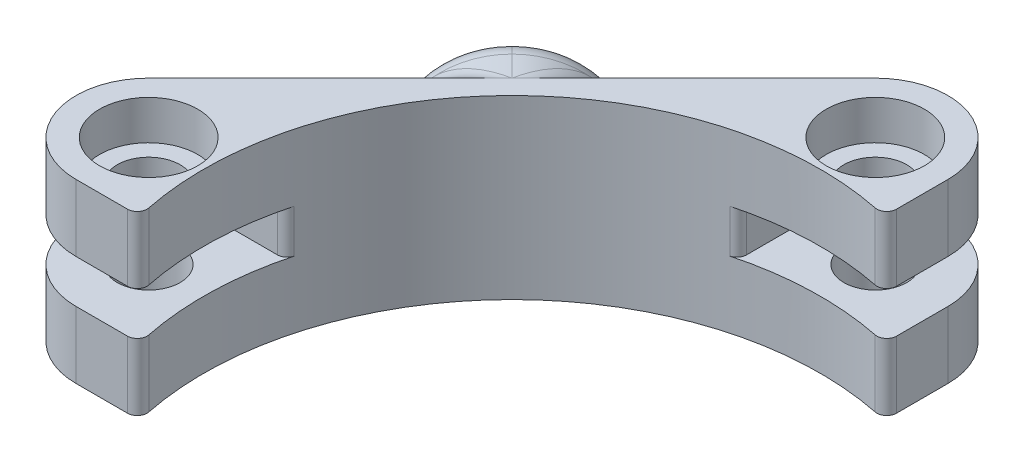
ISO-10303-21;
HEADER;
FILE_DESCRIPTION(('STEP AP214'),'2;1');
FILE_NAME('part.step','',(''),(''),'','','');
FILE_SCHEMA(('AUTOMOTIVE_DESIGN { 1 0 10303 214 1 1 1 1 }'));
ENDSEC;
DATA;
#1=APPLICATION_CONTEXT('core data for automotive mechanical design processes');
#2=APPLICATION_PROTOCOL_DEFINITION('international standard','automotive_design',2000,#1);
#3=PRODUCT_CONTEXT('',#1,'mechanical');
#4=PRODUCT('Part','Part','',(#3));
#5=PRODUCT_RELATED_PRODUCT_CATEGORY('part','',(#4));
#6=PRODUCT_DEFINITION_FORMATION('','',#4);
#7=PRODUCT_DEFINITION_CONTEXT('part definition',#1,'design');
#8=PRODUCT_DEFINITION('design','',#6,#7);
#9=PRODUCT_DEFINITION_SHAPE('','',#8);
#10=(LENGTH_UNIT() NAMED_UNIT(*) SI_UNIT(.MILLI.,.METRE.));
#11=(NAMED_UNIT(*) PLANE_ANGLE_UNIT() SI_UNIT($,.RADIAN.));
#12=(NAMED_UNIT(*) SI_UNIT($,.STERADIAN.) SOLID_ANGLE_UNIT());
#13=UNCERTAINTY_MEASURE_WITH_UNIT(LENGTH_MEASURE(1.E-05),#10,'distance_accuracy_value','');
#14=(GEOMETRIC_REPRESENTATION_CONTEXT(3) GLOBAL_UNCERTAINTY_ASSIGNED_CONTEXT((#13)) GLOBAL_UNIT_ASSIGNED_CONTEXT((#10,
#11,#12)) REPRESENTATION_CONTEXT('',''));
#15=CARTESIAN_POINT('',(0.,0.,0.));
#16=DIRECTION('',(0.,0.,1.));
#17=DIRECTION('',(1.,0.,0.));
#18=AXIS2_PLACEMENT_3D('',#15,#16,#17);
#19=CARTESIAN_POINT('',(0.,9.,0.));
#20=DIRECTION('',(0.,-1.,0.));
#21=DIRECTION('',(0.,0.,-1.));
#22=AXIS2_PLACEMENT_3D('',#19,#20,#21);
#23=CYLINDRICAL_SURFACE('',#22,15.7);
#24=CARTESIAN_POINT('',(0.,0.,0.));
#25=DIRECTION('',(0.,1.,0.));
#26=DIRECTION('',(0.,0.,1.));
#27=AXIS2_PLACEMENT_3D('',#24,#25,#26);
#28=CIRCLE('',#27,15.7);
#29=CARTESIAN_POINT('',(3.10123456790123,0.,-15.3906576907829));
#30=VERTEX_POINT('',#29);
#31=CARTESIAN_POINT('',(-15.3906576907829,0.,3.10123456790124));
#32=VERTEX_POINT('',#31);
#33=EDGE_CURVE('E336',#30,#32,#28,.T.);
#34=ORIENTED_EDGE('',*,*,#33,.F.);
#35=DIRECTION('',(0.,-1.,0.));
#36=VECTOR('',#35,1.);
#37=CARTESIAN_POINT('',(3.10123456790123,9.,-15.3906576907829));
#38=LINE('',#37,#36);
#39=CARTESIAN_POINT('',(3.10123456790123,3.4,-15.3906576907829));
#40=VERTEX_POINT('',#39);
#41=EDGE_CURVE('E410',#30,#40,#38,.F.);
#42=ORIENTED_EDGE('',*,*,#41,.T.);
#43=CARTESIAN_POINT('',(0.,3.4,0.));
#44=DIRECTION('',(0.,1.,0.));
#45=DIRECTION('',(0.,0.,1.));
#46=AXIS2_PLACEMENT_3D('',#43,#44,#45);
#47=CIRCLE('',#46,15.7);
#48=CARTESIAN_POINT('',(-4.07037037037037,3.4,-15.1631818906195));
#49=VERTEX_POINT('',#48);
#50=EDGE_CURVE('E784',#40,#49,#47,.T.);
#51=ORIENTED_EDGE('',*,*,#50,.T.);
#52=DIRECTION('',(0.,-1.,0.));
#53=VECTOR('',#52,1.);
#54=CARTESIAN_POINT('',(-4.07037037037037,9.,-15.1631818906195));
#55=LINE('',#54,#53);
#56=CARTESIAN_POINT('',(-4.07037037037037,5.6,-15.1631818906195));
#57=VERTEX_POINT('',#56);
#58=EDGE_CURVE('E369',#49,#57,#55,.F.);
#59=ORIENTED_EDGE('',*,*,#58,.T.);
#60=CARTESIAN_POINT('',(0.,5.6,0.));
#61=DIRECTION('',(0.,1.,0.));
#62=DIRECTION('',(0.,0.,1.));
#63=AXIS2_PLACEMENT_3D('',#60,#61,#62);
#64=CIRCLE('',#63,15.7);
#65=CARTESIAN_POINT('',(3.10123456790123,5.6,-15.3906576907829));
#66=VERTEX_POINT('',#65);
#67=EDGE_CURVE('E782',#66,#57,#64,.T.);
#68=ORIENTED_EDGE('',*,*,#67,.F.);
#69=DIRECTION('',(0.,-1.,0.));
#70=VECTOR('',#69,1.);
#71=CARTESIAN_POINT('',(3.10123456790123,9.,-15.3906576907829));
#72=LINE('',#71,#70);
#73=CARTESIAN_POINT('',(3.10123456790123,9.,-15.3906576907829));
#74=VERTEX_POINT('',#73);
#75=EDGE_CURVE('E408',#66,#74,#72,.F.);
#76=ORIENTED_EDGE('',*,*,#75,.T.);
#77=CARTESIAN_POINT('',(0.,9.,0.));
#78=DIRECTION('',(0.,1.,0.));
#79=DIRECTION('',(0.,0.,1.));
#80=AXIS2_PLACEMENT_3D('',#77,#78,#79);
#81=CIRCLE('',#80,15.7);
#82=CARTESIAN_POINT('',(-15.3906576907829,9.,3.10123456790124));
#83=VERTEX_POINT('',#82);
#84=EDGE_CURVE('E794',#74,#83,#81,.T.);
#85=ORIENTED_EDGE('',*,*,#84,.T.);
#86=DIRECTION('',(0.,-1.,0.));
#87=VECTOR('',#86,1.);
#88=CARTESIAN_POINT('',(-15.3906576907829,9.,3.10123456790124));
#89=LINE('',#88,#87);
#90=CARTESIAN_POINT('',(-15.3906576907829,5.6,3.10123456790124));
#91=VERTEX_POINT('',#90);
#92=EDGE_CURVE('E402',#83,#91,#89,.T.);
#93=ORIENTED_EDGE('',*,*,#92,.T.);
#94=CARTESIAN_POINT('',(0.,5.6,0.));
#95=DIRECTION('',(0.,1.,0.));
#96=DIRECTION('',(0.,0.,1.));
#97=AXIS2_PLACEMENT_3D('',#94,#95,#96);
#98=CIRCLE('',#97,15.7);
#99=CARTESIAN_POINT('',(-15.1631818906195,5.6,-4.07037037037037));
#100=VERTEX_POINT('',#99);
#101=EDGE_CURVE('E757',#100,#91,#98,.T.);
#102=ORIENTED_EDGE('',*,*,#101,.F.);
#103=DIRECTION('',(0.,-1.,0.));
#104=VECTOR('',#103,1.);
#105=CARTESIAN_POINT('',(-15.1631818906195,9.,-4.07037037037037));
#106=LINE('',#105,#104);
#107=CARTESIAN_POINT('',(-15.1631818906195,3.4,-4.07037037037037));
#108=VERTEX_POINT('',#107);
#109=EDGE_CURVE('E366',#100,#108,#106,.T.);
#110=ORIENTED_EDGE('',*,*,#109,.T.);
#111=CARTESIAN_POINT('',(0.,3.4,0.));
#112=DIRECTION('',(0.,1.,0.));
#113=DIRECTION('',(0.,0.,1.));
#114=AXIS2_PLACEMENT_3D('',#111,#112,#113);
#115=CIRCLE('',#114,15.7);
#116=CARTESIAN_POINT('',(-15.3906576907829,3.4,3.10123456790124));
#117=VERTEX_POINT('',#116);
#118=EDGE_CURVE('E760',#108,#117,#115,.T.);
#119=ORIENTED_EDGE('',*,*,#118,.T.);
#120=DIRECTION('',(0.,-1.,0.));
#121=VECTOR('',#120,1.);
#122=CARTESIAN_POINT('',(-15.3906576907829,9.,3.10123456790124));
#123=LINE('',#122,#121);
#124=EDGE_CURVE('E405',#117,#32,#123,.T.);
#125=ORIENTED_EDGE('',*,*,#124,.T.);
#126=EDGE_LOOP('',(#34,#42,#51,#59,#68,#76,#85,#93,#102,#110,#119,#125));
#127=FACE_BOUND('',#126,.T.);
#128=ADVANCED_FACE('F47',(#127),#23,.F.);
#129=CARTESIAN_POINT('',(-18.5,9.,0.));
#130=DIRECTION('',(0.,-1.,0.));
#131=DIRECTION('',(0.,0.,-1.));
#132=AXIS2_PLACEMENT_3D('',#129,#130,#131);
#133=CYLINDRICAL_SURFACE('',#132,3.7);
#134=CARTESIAN_POINT('',(-18.5,3.4,0.));
#135=DIRECTION('',(0.,1.,0.));
#136=DIRECTION('',(0.,0.,1.));
#137=AXIS2_PLACEMENT_3D('',#134,#135,#136);
#138=CIRCLE('',#137,3.7);
#139=CARTESIAN_POINT('',(-21.1162950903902,3.4,-2.61629509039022));
#140=VERTEX_POINT('',#139);
#141=CARTESIAN_POINT('',(-18.5,3.4,3.7));
#142=VERTEX_POINT('',#141);
#143=EDGE_CURVE('E281',#140,#142,#138,.T.);
#144=ORIENTED_EDGE('',*,*,#143,.F.);
#145=DIRECTION('',(0.,-1.,0.));
#146=VECTOR('',#145,1.);
#147=CARTESIAN_POINT('',(-21.1162950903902,9.,-2.61629509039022));
#148=LINE('',#147,#146);
#149=CARTESIAN_POINT('',(-21.1162950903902,0.,-2.61629509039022));
#150=VERTEX_POINT('',#149);
#151=EDGE_CURVE('E312',#140,#150,#148,.T.);
#152=ORIENTED_EDGE('',*,*,#151,.T.);
#153=CARTESIAN_POINT('',(-18.5,0.,0.));
#154=DIRECTION('',(0.,1.,0.));
#155=DIRECTION('',(0.,0.,1.));
#156=AXIS2_PLACEMENT_3D('',#153,#154,#155);
#157=CIRCLE('',#156,3.7);
#158=CARTESIAN_POINT('',(-18.5,0.,3.7));
#159=VERTEX_POINT('',#158);
#160=EDGE_CURVE('E306',#150,#159,#157,.T.);
#161=ORIENTED_EDGE('',*,*,#160,.T.);
#162=DIRECTION('',(0.,-1.,0.));
#163=VECTOR('',#162,1.);
#164=CARTESIAN_POINT('',(-18.5,9.,3.7));
#165=LINE('',#164,#163);
#166=EDGE_CURVE('E297',#142,#159,#165,.T.);
#167=ORIENTED_EDGE('',*,*,#166,.F.);
#168=EDGE_LOOP('',(#144,#152,#161,#167));
#169=FACE_BOUND('',#168,.T.);
#170=ADVANCED_FACE('F304',(#169),#133,.T.);
#171=CARTESIAN_POINT('',(0.,9.,3.7));
#172=DIRECTION('',(0.,0.,-1.));
#173=DIRECTION('',(-1.,0.,0.));
#174=AXIS2_PLACEMENT_3D('',#171,#172,#173);
#175=PLANE('',#174);
#176=DIRECTION('',(1.,0.,0.));
#177=VECTOR('',#176,1.);
#178=CARTESIAN_POINT('',(0.,0.,3.7));
#179=LINE('',#178,#177);
#180=CARTESIAN_POINT('',(-15.8808060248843,0.,3.7));
#181=VERTEX_POINT('',#180);
#182=EDGE_CURVE('E318',#159,#181,#179,.T.);
#183=ORIENTED_EDGE('',*,*,#182,.T.);
#184=DIRECTION('',(0.,1.,0.));
#185=VECTOR('',#184,1.);
#186=CARTESIAN_POINT('',(-15.8808060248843,3.4,3.7));
#187=LINE('',#186,#185);
#188=CARTESIAN_POINT('',(-15.8808060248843,3.4,3.7));
#189=VERTEX_POINT('',#188);
#190=EDGE_CURVE('E300',#181,#189,#187,.T.);
#191=ORIENTED_EDGE('',*,*,#190,.T.);
#192=DIRECTION('',(1.,0.,0.));
#193=VECTOR('',#192,1.);
#194=CARTESIAN_POINT('',(0.,3.4,3.7));
#195=LINE('',#194,#193);
#196=EDGE_CURVE('E284',#142,#189,#195,.T.);
#197=ORIENTED_EDGE('',*,*,#196,.F.);
#198=ORIENTED_EDGE('',*,*,#166,.T.);
#199=EDGE_LOOP('',(#183,#191,#197,#198));
#200=FACE_BOUND('',#199,.T.);
#201=ADVANCED_FACE('F296',(#200),#175,.F.);
#202=CARTESIAN_POINT('',(3.7,9.,0.));
#203=DIRECTION('',(1.,0.,0.));
#204=DIRECTION('',(0.,0.,-1.));
#205=AXIS2_PLACEMENT_3D('',#202,#203,#204);
#206=PLANE('',#205);
#207=DIRECTION('',(0.,0.,-1.));
#208=VECTOR('',#207,1.);
#209=CARTESIAN_POINT('',(3.7,3.4,0.));
#210=LINE('',#209,#208);
#211=CARTESIAN_POINT('',(3.7,3.4,-15.8808060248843));
#212=VERTEX_POINT('',#211);
#213=CARTESIAN_POINT('',(3.7,3.4,-18.5));
#214=VERTEX_POINT('',#213);
#215=EDGE_CURVE('E770',#212,#214,#210,.T.);
#216=ORIENTED_EDGE('',*,*,#215,.F.);
#217=DIRECTION('',(0.,-1.,0.));
#218=VECTOR('',#217,1.);
#219=CARTESIAN_POINT('',(3.7,9.,-15.8808060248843));
#220=LINE('',#219,#218);
#221=CARTESIAN_POINT('',(3.7,0.,-15.8808060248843));
#222=VERTEX_POINT('',#221);
#223=EDGE_CURVE('E395',#212,#222,#220,.T.);
#224=ORIENTED_EDGE('',*,*,#223,.T.);
#225=DIRECTION('',(0.,0.,1.));
#226=VECTOR('',#225,1.);
#227=CARTESIAN_POINT('',(3.7,0.,0.));
#228=LINE('',#227,#226);
#229=CARTESIAN_POINT('',(3.7,0.,-18.5));
#230=VERTEX_POINT('',#229);
#231=EDGE_CURVE('E812',#230,#222,#228,.T.);
#232=ORIENTED_EDGE('',*,*,#231,.F.);
#233=DIRECTION('',(0.,-1.,0.));
#234=VECTOR('',#233,1.);
#235=CARTESIAN_POINT('',(3.7,9.,-18.5));
#236=LINE('',#235,#234);
#237=EDGE_CURVE('E327',#214,#230,#236,.T.);
#238=ORIENTED_EDGE('',*,*,#237,.F.);
#239=EDGE_LOOP('',(#216,#224,#232,#238));
#240=FACE_BOUND('',#239,.T.);
#241=ADVANCED_FACE('F608',(#240),#206,.T.);
#242=CARTESIAN_POINT('',(0.,9.,-18.5));
#243=DIRECTION('',(0.,-1.,0.));
#244=DIRECTION('',(0.,0.,-1.));
#245=AXIS2_PLACEMENT_3D('',#242,#243,#244);
#246=CYLINDRICAL_SURFACE('',#245,3.7);
#247=CARTESIAN_POINT('',(0.,3.4,-18.5));
#248=DIRECTION('',(0.,1.,0.));
#249=DIRECTION('',(0.,0.,1.));
#250=AXIS2_PLACEMENT_3D('',#247,#248,#249);
#251=CIRCLE('',#250,3.7);
#252=CARTESIAN_POINT('',(-2.61629509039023,3.4,-21.1162950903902));
#253=VERTEX_POINT('',#252);
#254=EDGE_CURVE('E764',#214,#253,#251,.T.);
#255=ORIENTED_EDGE('',*,*,#254,.F.);
#256=ORIENTED_EDGE('',*,*,#237,.T.);
#257=CARTESIAN_POINT('',(0.,0.,-18.5));
#258=DIRECTION('',(0.,1.,0.));
#259=DIRECTION('',(0.,0.,1.));
#260=AXIS2_PLACEMENT_3D('',#257,#258,#259);
#261=CIRCLE('',#260,3.7);
#262=CARTESIAN_POINT('',(-2.61629509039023,0.,-21.1162950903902));
#263=VERTEX_POINT('',#262);
#264=EDGE_CURVE('E815',#230,#263,#261,.T.);
#265=ORIENTED_EDGE('',*,*,#264,.T.);
#266=DIRECTION('',(0.,-1.,0.));
#267=VECTOR('',#266,1.);
#268=CARTESIAN_POINT('',(-2.61629509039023,9.,-21.1162950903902));
#269=LINE('',#268,#267);
#270=EDGE_CURVE('E323',#253,#263,#269,.T.);
#271=ORIENTED_EDGE('',*,*,#270,.F.);
#272=EDGE_LOOP('',(#255,#256,#265,#271));
#273=FACE_BOUND('',#272,.T.);
#274=ADVANCED_FACE('F606',(#273),#246,.T.);
#275=DIRECTION('',(0.,0.,1.));
#276=VECTOR('',#275,1.);
#277=CARTESIAN_POINT('',(3.7,9.,0.));
#278=LINE('',#277,#276);
#279=CARTESIAN_POINT('',(3.7,9.,-18.5));
#280=VERTEX_POINT('',#279);
#281=CARTESIAN_POINT('',(3.7,9.,-15.8808060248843));
#282=VERTEX_POINT('',#281);
#283=EDGE_CURVE('E797',#280,#282,#278,.T.);
#284=ORIENTED_EDGE('',*,*,#283,.T.);
#285=DIRECTION('',(0.,-1.,0.));
#286=VECTOR('',#285,1.);
#287=CARTESIAN_POINT('',(3.7,9.,-15.8808060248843));
#288=LINE('',#287,#286);
#289=CARTESIAN_POINT('',(3.7,5.6,-15.8808060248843));
#290=VERTEX_POINT('',#289);
#291=EDGE_CURVE('E414',#282,#290,#288,.T.);
#292=ORIENTED_EDGE('',*,*,#291,.T.);
#293=DIRECTION('',(0.,0.,-1.));
#294=VECTOR('',#293,1.);
#295=CARTESIAN_POINT('',(3.7,5.6,0.));
#296=LINE('',#295,#294);
#297=CARTESIAN_POINT('',(3.7,5.6,-18.5));
#298=VERTEX_POINT('',#297);
#299=EDGE_CURVE('E778',#290,#298,#296,.T.);
#300=ORIENTED_EDGE('',*,*,#299,.T.);
#301=EDGE_CURVE('E328',#280,#298,#236,.T.);
#302=ORIENTED_EDGE('',*,*,#301,.F.);
#303=EDGE_LOOP('',(#284,#292,#300,#302));
#304=FACE_BOUND('',#303,.T.);
#305=ADVANCED_FACE('F602',(#304),#206,.T.);
#306=ORIENTED_EDGE('',*,*,#301,.T.);
#307=CARTESIAN_POINT('',(0.,5.6,-18.5));
#308=DIRECTION('',(0.,1.,0.));
#309=DIRECTION('',(0.,0.,1.));
#310=AXIS2_PLACEMENT_3D('',#307,#308,#309);
#311=CIRCLE('',#310,3.7);
#312=CARTESIAN_POINT('',(-2.61629509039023,5.6,-21.1162950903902));
#313=VERTEX_POINT('',#312);
#314=EDGE_CURVE('E773',#298,#313,#311,.T.);
#315=ORIENTED_EDGE('',*,*,#314,.T.);
#316=CARTESIAN_POINT('',(-2.61629509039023,9.,-21.1162950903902));
#317=VERTEX_POINT('',#316);
#318=EDGE_CURVE('E324',#317,#313,#269,.T.);
#319=ORIENTED_EDGE('',*,*,#318,.F.);
#320=CARTESIAN_POINT('',(0.,9.,-18.5));
#321=DIRECTION('',(0.,1.,0.));
#322=DIRECTION('',(0.,0.,1.));
#323=AXIS2_PLACEMENT_3D('',#320,#321,#322);
#324=CIRCLE('',#323,3.7);
#325=EDGE_CURVE('E800',#280,#317,#324,.T.);
#326=ORIENTED_EDGE('',*,*,#325,.F.);
#327=EDGE_LOOP('',(#306,#315,#319,#326));
#328=FACE_BOUND('',#327,.T.);
#329=ADVANCED_FACE('F605',(#328),#246,.T.);
#330=CARTESIAN_POINT('',(-11.8662950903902,9.,-11.8662950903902));
#331=DIRECTION('',(-0.707106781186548,0.,-0.707106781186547));
#332=DIRECTION('',(-0.707106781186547,0.,0.707106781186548));
#333=AXIS2_PLACEMENT_3D('',#330,#331,#332);
#334=PLANE('',#333);
#335=DIRECTION('',(0.707106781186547,0.,-0.707106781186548));
#336=VECTOR('',#335,1.);
#337=CARTESIAN_POINT('',(-11.8662950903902,0.,-11.8662950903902));
#338=LINE('',#337,#336);
#339=CARTESIAN_POINT('',(-9.06005205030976,0.,-14.6725381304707));
#340=VERTEX_POINT('',#339);
#341=EDGE_CURVE('E818',#340,#263,#338,.T.);
#342=ORIENTED_EDGE('',*,*,#341,.F.);
#343=CARTESIAN_POINT('',(-11.8662950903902,4.5,-11.8662950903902));
#344=DIRECTION('',(-0.707106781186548,0.,-0.707106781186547));
#345=DIRECTION('',(-0.707106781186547,0.,0.707106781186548));
#346=AXIS2_PLACEMENT_3D('',#343,#344,#345);
#347=CIRCLE('',#346,6.);
#348=CARTESIAN_POINT('',(-7.62365440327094,4.5,-16.1089357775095));
#349=VERTEX_POINT('',#348);
#350=EDGE_CURVE('E432',#340,#349,#347,.F.);
#351=ORIENTED_EDGE('',*,*,#350,.T.);
#352=CARTESIAN_POINT('',(-11.8662950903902,4.5,-11.8662950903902));
#353=DIRECTION('',(-0.707106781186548,0.,-0.707106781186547));
#354=DIRECTION('',(-0.707106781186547,0.,0.707106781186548));
#355=AXIS2_PLACEMENT_3D('',#352,#353,#354);
#356=CIRCLE('',#355,6.);
#357=CARTESIAN_POINT('',(-9.06005205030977,9.,-14.6725381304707));
#358=VERTEX_POINT('',#357);
#359=EDGE_CURVE('E430',#349,#358,#356,.F.);
#360=ORIENTED_EDGE('',*,*,#359,.T.);
#361=DIRECTION('',(0.707106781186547,0.,-0.707106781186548));
#362=VECTOR('',#361,1.);
#363=CARTESIAN_POINT('',(-11.8662950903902,9.,-11.8662950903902));
#364=LINE('',#363,#362);
#365=EDGE_CURVE('E803',#358,#317,#364,.T.);
#366=ORIENTED_EDGE('',*,*,#365,.T.);
#367=ORIENTED_EDGE('',*,*,#318,.T.);
#368=DIRECTION('',(-0.707106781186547,0.,0.707106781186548));
#369=VECTOR('',#368,1.);
#370=CARTESIAN_POINT('',(-11.8662950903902,5.6,-11.8662950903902));
#371=LINE('',#370,#369);
#372=CARTESIAN_POINT('',(-4.53983349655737,5.6,-19.1927566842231));
#373=VERTEX_POINT('',#372);
#374=EDGE_CURVE('E301',#313,#373,#371,.T.);
#375=ORIENTED_EDGE('',*,*,#374,.T.);
#376=DIRECTION('',(0.,-1.,0.));
#377=VECTOR('',#376,1.);
#378=CARTESIAN_POINT('',(-4.53983349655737,3.4,-19.1927566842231));
#379=LINE('',#378,#377);
#380=CARTESIAN_POINT('',(-4.53983349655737,3.4,-19.1927566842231));
#381=VERTEX_POINT('',#380);
#382=EDGE_CURVE('E351',#373,#381,#379,.T.);
#383=ORIENTED_EDGE('',*,*,#382,.T.);
#384=DIRECTION('',(0.707106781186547,0.,-0.707106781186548));
#385=VECTOR('',#384,1.);
#386=CARTESIAN_POINT('',(-11.8662950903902,3.4,-11.8662950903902));
#387=LINE('',#386,#385);
#388=EDGE_CURVE('E354',#381,#253,#387,.T.);
#389=ORIENTED_EDGE('',*,*,#388,.T.);
#390=ORIENTED_EDGE('',*,*,#270,.T.);
#391=EDGE_LOOP('',(#342,#351,#360,#366,#367,#375,#383,#389,#390));
#392=FACE_BOUND('',#391,.T.);
#393=ADVANCED_FACE('F610',(#392),#334,.T.);
#394=CARTESIAN_POINT('',(-11.8662950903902,4.5,-11.8662950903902));
#395=DIRECTION('',(-0.707106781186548,0.,-0.707106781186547));
#396=DIRECTION('',(-0.707106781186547,0.,0.707106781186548));
#397=AXIS2_PLACEMENT_3D('',#394,#395,#396);
#398=CIRCLE('',#397,6.);
#399=CARTESIAN_POINT('',(-14.6725381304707,9.,-9.06005205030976));
#400=VERTEX_POINT('',#399);
#401=CARTESIAN_POINT('',(-16.1089357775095,4.5,-7.62365440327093));
#402=VERTEX_POINT('',#401);
#403=EDGE_CURVE('E898',#400,#402,#398,.F.);
#404=ORIENTED_EDGE('',*,*,#403,.T.);
#405=CARTESIAN_POINT('',(-11.8662950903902,4.5,-11.8662950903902));
#406=DIRECTION('',(-0.707106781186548,0.,-0.707106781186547));
#407=DIRECTION('',(-0.707106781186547,0.,0.707106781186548));
#408=AXIS2_PLACEMENT_3D('',#405,#406,#407);
#409=CIRCLE('',#408,6.);
#410=CARTESIAN_POINT('',(-14.6725381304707,0.,-9.06005205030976));
#411=VERTEX_POINT('',#410);
#412=EDGE_CURVE('E895',#402,#411,#409,.F.);
#413=ORIENTED_EDGE('',*,*,#412,.T.);
#414=EDGE_CURVE('E822',#150,#411,#338,.T.);
#415=ORIENTED_EDGE('',*,*,#414,.F.);
#416=ORIENTED_EDGE('',*,*,#151,.F.);
#417=DIRECTION('',(0.707106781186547,0.,-0.707106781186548));
#418=VECTOR('',#417,1.);
#419=CARTESIAN_POINT('',(-11.8662950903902,3.4,-11.8662950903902));
#420=LINE('',#419,#418);
#421=CARTESIAN_POINT('',(-19.1927566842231,3.4,-4.53983349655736));
#422=VERTEX_POINT('',#421);
#423=EDGE_CURVE('E287',#140,#422,#420,.T.);
#424=ORIENTED_EDGE('',*,*,#423,.T.);
#425=DIRECTION('',(0.,-1.,0.));
#426=VECTOR('',#425,1.);
#427=CARTESIAN_POINT('',(-19.1927566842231,5.6,-4.53983349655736));
#428=LINE('',#427,#426);
#429=CARTESIAN_POINT('',(-19.1927566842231,5.6,-4.53983349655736));
#430=VERTEX_POINT('',#429);
#431=EDGE_CURVE('E359',#422,#430,#428,.F.);
#432=ORIENTED_EDGE('',*,*,#431,.T.);
#433=DIRECTION('',(-0.707106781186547,0.,0.707106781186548));
#434=VECTOR('',#433,1.);
#435=CARTESIAN_POINT('',(-11.8662950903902,5.6,-11.8662950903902));
#436=LINE('',#435,#434);
#437=CARTESIAN_POINT('',(-21.1162950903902,5.6,-2.61629509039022));
#438=VERTEX_POINT('',#437);
#439=EDGE_CURVE('E362',#430,#438,#436,.T.);
#440=ORIENTED_EDGE('',*,*,#439,.T.);
#441=CARTESIAN_POINT('',(-21.1162950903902,9.,-2.61629509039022));
#442=VERTEX_POINT('',#441);
#443=EDGE_CURVE('E320',#442,#438,#148,.T.);
#444=ORIENTED_EDGE('',*,*,#443,.F.);
#445=EDGE_CURVE('E808',#442,#400,#364,.T.);
#446=ORIENTED_EDGE('',*,*,#445,.T.);
#447=EDGE_LOOP('',(#404,#413,#415,#416,#424,#432,#440,#444,#446));
#448=FACE_BOUND('',#447,.T.);
#449=ADVANCED_FACE('F612',(#448),#334,.T.);
#450=ORIENTED_EDGE('',*,*,#443,.T.);
#451=CARTESIAN_POINT('',(-18.5,5.6,0.));
#452=DIRECTION('',(0.,1.,0.));
#453=DIRECTION('',(0.,0.,1.));
#454=AXIS2_PLACEMENT_3D('',#451,#452,#453);
#455=CIRCLE('',#454,3.7);
#456=CARTESIAN_POINT('',(-18.5,5.6,3.7));
#457=VERTEX_POINT('',#456);
#458=EDGE_CURVE('E738',#438,#457,#455,.T.);
#459=ORIENTED_EDGE('',*,*,#458,.T.);
#460=CARTESIAN_POINT('',(-18.5,9.,3.7));
#461=VERTEX_POINT('',#460);
#462=EDGE_CURVE('E308',#461,#457,#165,.T.);
#463=ORIENTED_EDGE('',*,*,#462,.F.);
#464=CARTESIAN_POINT('',(-18.5,9.,0.));
#465=DIRECTION('',(0.,1.,0.));
#466=DIRECTION('',(0.,0.,1.));
#467=AXIS2_PLACEMENT_3D('',#464,#465,#466);
#468=CIRCLE('',#467,3.7);
#469=EDGE_CURVE('E314',#442,#461,#468,.T.);
#470=ORIENTED_EDGE('',*,*,#469,.F.);
#471=EDGE_LOOP('',(#450,#459,#463,#470));
#472=FACE_BOUND('',#471,.T.);
#473=ADVANCED_FACE('F599',(#472),#133,.T.);
#474=DIRECTION('',(1.,0.,0.));
#475=VECTOR('',#474,1.);
#476=CARTESIAN_POINT('',(0.,5.6,3.7));
#477=LINE('',#476,#475);
#478=CARTESIAN_POINT('',(-15.8808060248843,5.6,3.7));
#479=VERTEX_POINT('',#478);
#480=EDGE_CURVE('E302',#457,#479,#477,.T.);
#481=ORIENTED_EDGE('',*,*,#480,.T.);
#482=DIRECTION('',(0.,1.,0.));
#483=VECTOR('',#482,1.);
#484=CARTESIAN_POINT('',(-15.8808060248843,9.,3.7));
#485=LINE('',#484,#483);
#486=CARTESIAN_POINT('',(-15.8808060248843,9.,3.7));
#487=VERTEX_POINT('',#486);
#488=EDGE_CURVE('E428',#479,#487,#485,.T.);
#489=ORIENTED_EDGE('',*,*,#488,.T.);
#490=DIRECTION('',(1.,0.,0.));
#491=VECTOR('',#490,1.);
#492=CARTESIAN_POINT('',(0.,9.,3.7));
#493=LINE('',#492,#491);
#494=EDGE_CURVE('E309',#461,#487,#493,.T.);
#495=ORIENTED_EDGE('',*,*,#494,.F.);
#496=ORIENTED_EDGE('',*,*,#462,.T.);
#497=EDGE_LOOP('',(#481,#489,#495,#496));
#498=FACE_BOUND('',#497,.T.);
#499=ADVANCED_FACE('F621',(#498),#175,.F.);
#500=CARTESIAN_POINT('',(0.,9.,0.));
#501=DIRECTION('',(0.,1.,0.));
#502=DIRECTION('',(0.,0.,1.));
#503=AXIS2_PLACEMENT_3D('',#500,#501,#502);
#504=PLANE('',#503);
#505=CARTESIAN_POINT('',(-18.5,9.,0.));
#506=DIRECTION('',(0.,1.,0.));
#507=DIRECTION('',(0.,0.,1.));
#508=AXIS2_PLACEMENT_3D('',#505,#506,#507);
#509=CIRCLE('',#508,2.5);
#510=CARTESIAN_POINT('',(-18.5,9.,2.5));
#511=VERTEX_POINT('',#510);
#512=EDGE_CURVE('E739',#511,#511,#509,.T.);
#513=ORIENTED_EDGE('',*,*,#512,.F.);
#514=EDGE_LOOP('',(#513));
#515=FACE_BOUND('',#514,.T.);
#516=CARTESIAN_POINT('',(0.,9.,-18.5));
#517=DIRECTION('',(0.,1.,0.));
#518=DIRECTION('',(0.,0.,1.));
#519=AXIS2_PLACEMENT_3D('',#516,#517,#518);
#520=CIRCLE('',#519,2.5);
#521=CARTESIAN_POINT('',(0.,9.,-16.));
#522=VERTEX_POINT('',#521);
#523=EDGE_CURVE('E742',#522,#522,#520,.T.);
#524=ORIENTED_EDGE('',*,*,#523,.F.);
#525=EDGE_LOOP('',(#524));
#526=FACE_BOUND('',#525,.T.);
#527=ORIENTED_EDGE('',*,*,#84,.F.);
#528=CARTESIAN_POINT('',(3.2,9.,-15.8808060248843));
#529=DIRECTION('',(0.,1.,0.));
#530=DIRECTION('',(0.,0.,1.));
#531=AXIS2_PLACEMENT_3D('',#528,#529,#530);
#532=CIRCLE('',#531,0.5);
#533=EDGE_CURVE('E421',#74,#282,#532,.T.);
#534=ORIENTED_EDGE('',*,*,#533,.T.);
#535=ORIENTED_EDGE('',*,*,#283,.F.);
#536=ORIENTED_EDGE('',*,*,#325,.T.);
#537=ORIENTED_EDGE('',*,*,#365,.F.);
#538=CARTESIAN_POINT('',(-11.8662950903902,9.,-11.8662950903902));
#539=VERTEX_POINT('',#538);
#540=EDGE_CURVE('E804',#539,#358,#364,.T.);
#541=ORIENTED_EDGE('',*,*,#540,.F.);
#542=EDGE_CURVE('E807',#400,#539,#364,.T.);
#543=ORIENTED_EDGE('',*,*,#542,.F.);
#544=ORIENTED_EDGE('',*,*,#445,.F.);
#545=ORIENTED_EDGE('',*,*,#469,.T.);
#546=ORIENTED_EDGE('',*,*,#494,.T.);
#547=CARTESIAN_POINT('',(-15.8808060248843,9.,3.2));
#548=DIRECTION('',(0.,1.,0.));
#549=DIRECTION('',(0.,0.,1.));
#550=AXIS2_PLACEMENT_3D('',#547,#548,#549);
#551=CIRCLE('',#550,0.5);
#552=EDGE_CURVE('E419',#487,#83,#551,.T.);
#553=ORIENTED_EDGE('',*,*,#552,.T.);
#554=EDGE_LOOP('',(#527,#534,#535,#536,#537,#541,#543,#544,#545,#546,#553));
#555=FACE_BOUND('',#554,.T.);
#556=ADVANCED_FACE('F624',(#515,#526,#555),#504,.T.);
#557=CARTESIAN_POINT('',(0.,0.,0.));
#558=DIRECTION('',(0.,1.,0.));
#559=DIRECTION('',(0.,0.,1.));
#560=AXIS2_PLACEMENT_3D('',#557,#558,#559);
#561=PLANE('',#560);
#562=CARTESIAN_POINT('',(-18.5,0.,0.));
#563=DIRECTION('',(0.,-1.,0.));
#564=DIRECTION('',(0.,0.,-1.));
#565=AXIS2_PLACEMENT_3D('',#562,#563,#564);
#566=CIRCLE('',#565,1.6);
#567=CARTESIAN_POINT('',(-18.5,0.,-1.6));
#568=VERTEX_POINT('',#567);
#569=EDGE_CURVE('E343',#568,#568,#566,.T.);
#570=ORIENTED_EDGE('',*,*,#569,.F.);
#571=EDGE_LOOP('',(#570));
#572=FACE_BOUND('',#571,.T.);
#573=CARTESIAN_POINT('',(0.,0.,-18.5));
#574=DIRECTION('',(0.,-1.,0.));
#575=DIRECTION('',(0.,0.,-1.));
#576=AXIS2_PLACEMENT_3D('',#573,#574,#575);
#577=CIRCLE('',#576,1.6);
#578=CARTESIAN_POINT('',(0.,0.,-20.1));
#579=VERTEX_POINT('',#578);
#580=EDGE_CURVE('E726',#579,#579,#577,.T.);
#581=ORIENTED_EDGE('',*,*,#580,.F.);
#582=EDGE_LOOP('',(#581));
#583=FACE_BOUND('',#582,.T.);
#584=ORIENTED_EDGE('',*,*,#231,.T.);
#585=CARTESIAN_POINT('',(3.2,0.,-15.8808060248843));
#586=DIRECTION('',(0.,1.,0.));
#587=DIRECTION('',(0.,0.,1.));
#588=AXIS2_PLACEMENT_3D('',#585,#586,#587);
#589=CIRCLE('',#588,0.5);
#590=EDGE_CURVE('E400',#222,#30,#589,.F.);
#591=ORIENTED_EDGE('',*,*,#590,.T.);
#592=ORIENTED_EDGE('',*,*,#33,.T.);
#593=CARTESIAN_POINT('',(-15.8808060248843,0.,3.2));
#594=DIRECTION('',(0.,1.,0.));
#595=DIRECTION('',(0.,0.,1.));
#596=AXIS2_PLACEMENT_3D('',#593,#594,#595);
#597=CIRCLE('',#596,0.5);
#598=EDGE_CURVE('E398',#32,#181,#597,.F.);
#599=ORIENTED_EDGE('',*,*,#598,.T.);
#600=ORIENTED_EDGE('',*,*,#182,.F.);
#601=ORIENTED_EDGE('',*,*,#160,.F.);
#602=ORIENTED_EDGE('',*,*,#414,.T.);
#603=CARTESIAN_POINT('',(-11.8662950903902,0.,-11.8662950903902));
#604=VERTEX_POINT('',#603);
#605=EDGE_CURVE('E821',#411,#604,#338,.T.);
#606=ORIENTED_EDGE('',*,*,#605,.T.);
#607=EDGE_CURVE('E819',#604,#340,#338,.T.);
#608=ORIENTED_EDGE('',*,*,#607,.T.);
#609=ORIENTED_EDGE('',*,*,#341,.T.);
#610=ORIENTED_EDGE('',*,*,#264,.F.);
#611=EDGE_LOOP('',(#584,#591,#592,#599,#600,#601,#602,#606,#608,#609,#610));
#612=FACE_BOUND('',#611,.T.);
#613=ADVANCED_FACE('F626',(#572,#583,#612),#561,.F.);
#614=CARTESIAN_POINT('',(0.,4.5,0.));
#615=DIRECTION('',(0.707106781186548,0.,0.707106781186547));
#616=DIRECTION('',(0.707106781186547,0.,-0.707106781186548));
#617=AXIS2_PLACEMENT_3D('',#614,#615,#616);
#618=CYLINDRICAL_SURFACE('',#617,4.5);
#619=CARTESIAN_POINT('',(-15.0975566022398,0.,-8.63503357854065));
#620=CARTESIAN_POINT('',(-13.6515620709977,1.10146533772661,-9.38514618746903));
#621=CARTESIAN_POINT('',(-15.2581598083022,1.58386940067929,-10.4112675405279));
#622=CARTESIAN_POINT('',(-15.0692348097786,0.,-8.66335537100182));
#623=CARTESIAN_POINT('',(-13.6834434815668,1.12280010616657,-9.4033638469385));
#624=CARTESIAN_POINT('',(-15.2517884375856,1.54855289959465,-10.4473788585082));
#625=CARTESIAN_POINT('',(-15.0399722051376,0.,-8.69261797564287));
#626=CARTESIAN_POINT('',(-13.7150371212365,1.13908692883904,-9.42503922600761));
#627=CARTESIAN_POINT('',(-15.2426812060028,1.51319238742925,-10.4821655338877));
#628=CARTESIAN_POINT('',(-14.9798333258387,0.,-8.7527568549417));
#629=CARTESIAN_POINT('',(-13.7748698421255,1.16186263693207,-9.47346351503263));
#630=CARTESIAN_POINT('',(-15.2195028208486,1.44281980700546,-10.5491954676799));
#631=CARTESIAN_POINT('',(-14.9489600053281,0.,-8.78363017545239));
#632=CARTESIAN_POINT('',(-13.8031646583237,1.16858278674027,-9.50006554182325));
#633=CARTESIAN_POINT('',(-15.2054405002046,1.40780723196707,-10.5814431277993));
#634=CARTESIAN_POINT('',(-14.8548216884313,0.,-8.87776849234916));
#635=CARTESIAN_POINT('',(-13.8792670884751,1.17580076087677,-9.58376118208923));
#636=CARTESIAN_POINT('',(-15.156867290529,1.30447200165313,-10.6740773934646));
#637=CARTESIAN_POINT('',(-14.7894446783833,0.,-8.94314550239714));
#638=CARTESIAN_POINT('',(-13.921345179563,1.16503107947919,-9.64655141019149));
#639=CARTESIAN_POINT('',(-15.1158174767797,1.23710779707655,-10.7310930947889));
#640=CARTESIAN_POINT('',(-14.6236580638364,0.,-9.108932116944));
#641=CARTESIAN_POINT('',(-13.9932434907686,1.11183698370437,-9.80603398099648));
#642=CARTESIAN_POINT('',(-14.9978043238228,1.07707135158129,-10.8617598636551));
#643=CARTESIAN_POINT('',(-14.5209082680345,0.,-9.21168191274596));
#644=CARTESIAN_POINT('',(-14.0124105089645,1.05874035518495,-9.90692970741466));
#645=CARTESIAN_POINT('',(-14.9130027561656,0.986925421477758,-10.931082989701));
#646=CARTESIAN_POINT('',(-14.3091540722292,0.,-9.42343610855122));
#647=CARTESIAN_POINT('',(-14.0014469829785,0.934581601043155,-10.1069618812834));
#648=CARTESIAN_POINT('',(-14.7221128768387,0.818093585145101,-11.0578244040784));
#649=CARTESIAN_POINT('',(-14.2001158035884,0.,-9.53247437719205));
#650=CARTESIAN_POINT('',(-13.9735927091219,0.864017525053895,-10.2067324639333));
#651=CARTESIAN_POINT('',(-14.6158997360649,0.739479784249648,-11.1151686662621));
#652=CARTESIAN_POINT('',(-14.0039592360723,0.,-9.72863094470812));
#653=CARTESIAN_POINT('',(-13.8907671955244,0.738087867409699,-10.3783336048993));
#654=CARTESIAN_POINT('',(-14.4150057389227,0.611496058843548,-11.2085095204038));
#655=CARTESIAN_POINT('',(-13.9176125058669,0.,-9.81497767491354));
#656=CARTESIAN_POINT('',(-13.8446232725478,0.683280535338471,-10.4510514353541));
#657=CARTESIAN_POINT('',(-14.3233505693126,0.55956987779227,-11.2463744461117));
#658=CARTESIAN_POINT('',(-13.7432173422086,0.,-9.9893728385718));
#659=CARTESIAN_POINT('',(-13.7353441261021,0.577250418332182,-10.5926456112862));
#660=CARTESIAN_POINT('',(-14.1332617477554,0.462958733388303,-11.3178783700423));
#661=CARTESIAN_POINT('',(-13.6551682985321,0.,-10.0774218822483));
#662=CARTESIAN_POINT('',(-13.6724833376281,0.525723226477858,-10.6619015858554));
#663=CARTESIAN_POINT('',(-14.034825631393,0.418276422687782,-11.3515158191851));
#664=CARTESIAN_POINT('',(-13.3891172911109,0.,-10.3434728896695));
#665=CARTESIAN_POINT('',(-13.4668403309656,0.382051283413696,-10.8618455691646));
#666=CARTESIAN_POINT('',(-13.7317532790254,0.294848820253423,-11.4475199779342));
#667=CARTESIAN_POINT('',(-13.2091616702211,0.,-10.5234285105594));
#668=CARTESIAN_POINT('',(-13.3021457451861,0.295346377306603,-10.9916512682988));
#669=CARTESIAN_POINT('',(-13.5193006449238,0.226690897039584,-11.5050007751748));
#670=CARTESIAN_POINT('',(-12.8377594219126,0.,-10.8948307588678));
#671=CARTESIAN_POINT('',(-12.936826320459,0.152420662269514,-11.2458091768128));
#672=CARTESIAN_POINT('',(-13.0721632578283,0.114529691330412,-11.6149667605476));
#673=CARTESIAN_POINT('',(-12.6461837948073,0.,-11.0864063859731));
#674=CARTESIAN_POINT('',(-12.7325349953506,0.0954886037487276,-11.3722177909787));
#675=CARTESIAN_POINT('',(-12.8368987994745,0.0718835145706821,-11.6670657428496));
#676=CARTESIAN_POINT('',(-12.2617033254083,0.,-11.4708868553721));
#677=CARTESIAN_POINT('',(-12.312731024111,0.0202093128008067,-11.6181585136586));
#678=CARTESIAN_POINT('',(-12.3605281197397,0.0148672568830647,-11.7674157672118));
#679=CARTESIAN_POINT('',(-12.0687991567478,0.,-11.6637910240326));
#680=CARTESIAN_POINT('',(-12.0941387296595,0.000650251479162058,-11.739713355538));
#681=CARTESIAN_POINT('',(-12.1194247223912,0.000483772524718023,-11.8156686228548));
#682=CARTESIAN_POINT('',(-11.8728270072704,0.,-11.85976317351));
#683=CARTESIAN_POINT('',(-11.8736435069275,5.25194544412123E-06,-11.8622126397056));
#684=CARTESIAN_POINT('',(-11.8744599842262,4.00427112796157E-06,-11.8646621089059));
#685=CARTESIAN_POINT('',(-11.8695610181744,0.,-11.8630291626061));
#686=CARTESIAN_POINT('',(-11.8699692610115,-8.39689979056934E-08,-11.8642538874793));
#687=CARTESIAN_POINT('',(-11.8703774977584,4.59717929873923E-09,-11.8654786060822));
#688=CARTESIAN_POINT('',(-11.8662950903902,0.,-11.8662950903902));
#689=CARTESIAN_POINT('',(-11.8662950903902,0.,-11.8662950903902));
#690=CARTESIAN_POINT('',(-11.8662950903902,0.,-11.8662950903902));
#691=(BOUNDED_SURFACE() B_SPLINE_SURFACE(3,2,((#619,#620,#621),(#622,#623,#624),(#625,#626,
#627),(#628,#629,#630),(#631,#632,#633),(#634,#635,#636),(#637,#638,#639),(#640,#641,#642),
(#643,#644,#645),(#646,#647,#648),(#649,#650,#651),(#652,#653,#654),(#655,#656,#657),(#658,#659,
#660),(#661,#662,#663),(#664,#665,#666),(#667,#668,#669),(#670,#671,#672),(#673,#674,#675),
(#676,#677,#678),(#679,#680,#681),(#682,#683,#684),(#685,#686,#687),(#688,#689,#690)),
.UNSPECIFIED.,.F.,.F.,.F.) B_SPLINE_SURFACE_WITH_KNOTS((4,2,2,2,2,2,2,2,2,2,2,4),(3,3),(0.,
0.195713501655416,0.39107987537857,0.777773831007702,1.34143335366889,1.90847932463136,
2.34420582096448,2.78009151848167,3.65161087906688,4.56611377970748,5.48018287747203,
5.49567481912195),(0.,1.),
.UNSPECIFIED.) GEOMETRIC_REPRESENTATION_ITEM() RATIONAL_B_SPLINE_SURFACE(((1.,0.606497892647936,
1.),(1.,0.613562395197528,1.),(1.,0.620820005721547,1.),(1.,0.635585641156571,1.),(1.,
0.643093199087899,1.),(1.,0.665670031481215,1.),(1.,0.680944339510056,1.),(1.,0.718190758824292,
1.),(1.,0.740029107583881,1.),(1.,0.781880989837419,1.),(1.,0.801882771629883,1.),(1.,
0.834933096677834,1.),(1.,0.848519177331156,1.),(1.,0.874014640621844,1.),(1.,0.885923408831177,
1.),(1.,0.919018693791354,1.),(1.,0.937582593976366,1.),(1.,0.968294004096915,1.),(1.,
0.980079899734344,1.),(1.,0.995863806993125,1.),(1.,0.999865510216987,1.),(1.,0.999998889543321,
1.),(1.,1.00000000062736,1.),(1.,1.,1.))) REPRESENTATION_ITEM('') SURFACE());
#692=CARTESIAN_POINT('',(-15.2581598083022,1.58386940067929,-10.4112675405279));
#693=CARTESIAN_POINT('',(-15.2517884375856,1.54855289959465,-10.4473788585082));
#694=CARTESIAN_POINT('',(-15.2426812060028,1.51319238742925,-10.4821655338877));
#695=CARTESIAN_POINT('',(-15.2195028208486,1.44281980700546,-10.5491954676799));
#696=CARTESIAN_POINT('',(-15.2054405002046,1.40780723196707,-10.5814431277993));
#697=CARTESIAN_POINT('',(-15.156867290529,1.30447200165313,-10.6740773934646));
#698=CARTESIAN_POINT('',(-15.1158174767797,1.23710779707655,-10.7310930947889));
#699=CARTESIAN_POINT('',(-14.9978043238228,1.07707135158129,-10.8617598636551));
#700=CARTESIAN_POINT('',(-14.9130027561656,0.986925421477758,-10.931082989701));
#701=CARTESIAN_POINT('',(-14.7221128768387,0.818093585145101,-11.0578244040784));
#702=CARTESIAN_POINT('',(-14.6158997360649,0.739479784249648,-11.1151686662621));
#703=CARTESIAN_POINT('',(-14.4150057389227,0.611496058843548,-11.2085095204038));
#704=CARTESIAN_POINT('',(-14.3233505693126,0.55956987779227,-11.2463744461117));
#705=CARTESIAN_POINT('',(-14.1332617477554,0.462958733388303,-11.3178783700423));
#706=CARTESIAN_POINT('',(-14.034825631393,0.418276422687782,-11.3515158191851));
#707=CARTESIAN_POINT('',(-13.7317532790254,0.294848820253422,-11.4475199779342));
#708=CARTESIAN_POINT('',(-13.5193006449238,0.226690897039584,-11.5050007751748));
#709=CARTESIAN_POINT('',(-13.0721632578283,0.114529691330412,-11.6149667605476));
#710=CARTESIAN_POINT('',(-12.8368987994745,0.0718835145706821,-11.6670657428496));
#711=CARTESIAN_POINT('',(-12.3605281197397,0.0148672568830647,-11.7674157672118));
#712=CARTESIAN_POINT('',(-12.1194247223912,0.000483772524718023,-11.8156686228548));
#713=CARTESIAN_POINT('',(-11.8744599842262,4.00427112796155E-06,-11.8646621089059));
#714=CARTESIAN_POINT('',(-11.8703774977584,4.59717929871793E-09,-11.8654786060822));
#715=CARTESIAN_POINT('',(-11.8662950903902,0.,-11.8662950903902));
#716=B_SPLINE_CURVE_WITH_KNOTS('',3,(#692,#693,#694,#695,#696,#697,#698,#699,#700,#701,#702,
#703,#704,#705,#706,#707,#708,#709,#710,#711,#712,#713,#714,#715),.UNSPECIFIED.,.F.,.F.,(4,2,2,
2,2,2,2,2,2,2,2,4),(0.,0.195713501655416,0.39107987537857,0.777773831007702,1.34143335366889,
1.90847932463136,2.34420582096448,2.78009151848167,3.65161087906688,4.56611377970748,
5.48018287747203,5.49567481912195),.UNSPECIFIED.);
#717=CARTESIAN_POINT('',(-15.0316375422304,1.125,-10.8222729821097));
#718=VERTEX_POINT('',#717);
#719=EDGE_CURVE('E904',#604,#718,#716,.F.);
#720=ORIENTED_EDGE('',*,*,#719,.T.);
#721=CARTESIAN_POINT('',(-12.9269552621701,4.5,-12.9269552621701));
#722=DIRECTION('',(-0.707106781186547,0.,-0.707106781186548));
#723=DIRECTION('',(-0.707106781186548,0.,0.707106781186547));
#724=AXIS2_PLACEMENT_3D('',#721,#722,#723);
#725=CIRCLE('',#724,4.5);
#726=CARTESIAN_POINT('',(-12.9269552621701,0.,-12.9269552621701));
#727=VERTEX_POINT('',#726);
#728=EDGE_CURVE('E71',#718,#727,#725,.F.);
#729=ORIENTED_EDGE('',*,*,#728,.T.);
#730=DIRECTION('',(0.707106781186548,0.,0.707106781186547));
#731=VECTOR('',#730,1.);
#732=CARTESIAN_POINT('',(0.,0.,0.));
#733=LINE('',#732,#731);
#734=EDGE_CURVE('E333',#604,#727,#733,.F.);
#735=ORIENTED_EDGE('',*,*,#734,.F.);
#736=EDGE_LOOP('',(#720,#729,#735));
#737=FACE_BOUND('',#736,.T.);
#738=ADVANCED_FACE('F537',(#737),#618,.T.);
#739=CARTESIAN_POINT('',(0.,4.5,0.));
#740=DIRECTION('',(-0.707106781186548,0.,-0.707106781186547));
#741=DIRECTION('',(-0.707106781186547,0.,0.707106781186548));
#742=AXIS2_PLACEMENT_3D('',#739,#740,#741);
#743=CYLINDRICAL_SURFACE('',#742,4.5);
#744=DIRECTION('',(0.707106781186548,0.,0.707106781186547));
#745=VECTOR('',#744,1.);
#746=CARTESIAN_POINT('',(-11.8662950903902,9.,-11.8662950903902));
#747=LINE('',#746,#745);
#748=CARTESIAN_POINT('',(-12.9269552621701,9.,-12.9269552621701));
#749=VERTEX_POINT('',#748);
#750=EDGE_CURVE('E331',#749,#539,#747,.T.);
#751=ORIENTED_EDGE('',*,*,#750,.F.);
#752=CARTESIAN_POINT('',(-12.9269552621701,4.5,-12.9269552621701));
#753=DIRECTION('',(-0.707106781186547,0.,-0.707106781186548));
#754=DIRECTION('',(-0.707106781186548,0.,0.707106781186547));
#755=AXIS2_PLACEMENT_3D('',#752,#753,#754);
#756=CIRCLE('',#755,4.5);
#757=CARTESIAN_POINT('',(-15.0316375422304,7.875,-10.8222729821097));
#758=VERTEX_POINT('',#757);
#759=EDGE_CURVE('E11',#749,#758,#756,.F.);
#760=ORIENTED_EDGE('',*,*,#759,.T.);
#761=CARTESIAN_POINT('',(-15.2581598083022,7.41613059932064,-10.4112675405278));
#762=CARTESIAN_POINT('',(-13.6515620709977,7.89853466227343,-9.38514618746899));
#763=CARTESIAN_POINT('',(-15.0975566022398,9.,-8.63503357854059));
#764=CARTESIAN_POINT('',(-15.2517884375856,7.45144710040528,-10.4473788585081));
#765=CARTESIAN_POINT('',(-13.6834434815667,7.87719989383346,-9.40336384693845));
#766=CARTESIAN_POINT('',(-15.0692348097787,9.,-8.66335537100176));
#767=CARTESIAN_POINT('',(-15.2426812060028,7.48680761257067,-10.4821655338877));
#768=CARTESIAN_POINT('',(-13.7150371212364,7.86091307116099,-9.42503922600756));
#769=CARTESIAN_POINT('',(-15.0399722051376,9.,-8.69261797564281));
#770=CARTESIAN_POINT('',(-15.2195028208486,7.55718019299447,-10.5491954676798));
#771=CARTESIAN_POINT('',(-13.7748698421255,7.83813736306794,-9.47346351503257));
#772=CARTESIAN_POINT('',(-14.9798333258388,9.,-8.75275685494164));
#773=CARTESIAN_POINT('',(-15.2054405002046,7.59219276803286,-10.5814431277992));
#774=CARTESIAN_POINT('',(-13.8031646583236,7.83141721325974,-9.50006554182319));
#775=CARTESIAN_POINT('',(-14.9489600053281,9.,-8.78363017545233));
#776=CARTESIAN_POINT('',(-15.1568672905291,7.69552799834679,-10.6740773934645));
#777=CARTESIAN_POINT('',(-13.879267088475,7.82419923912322,-9.58376118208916));
#778=CARTESIAN_POINT('',(-14.8548216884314,9.,-8.87776849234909));
#779=CARTESIAN_POINT('',(-15.1158174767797,7.76289220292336,-10.7310930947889));
#780=CARTESIAN_POINT('',(-13.921345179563,7.83496892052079,-9.6465514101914));
#781=CARTESIAN_POINT('',(-14.7894446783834,9.,-8.94314550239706));
#782=CARTESIAN_POINT('',(-14.9978043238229,7.92292864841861,-10.861759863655));
#783=CARTESIAN_POINT('',(-13.9932434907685,7.88816301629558,-9.80603398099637));
#784=CARTESIAN_POINT('',(-14.6236580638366,9.,-9.10893211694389));
#785=CARTESIAN_POINT('',(-14.9130027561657,8.01307457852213,-10.9310829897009));
#786=CARTESIAN_POINT('',(-14.0124105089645,7.94125964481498,-9.90692970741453));
#787=CARTESIAN_POINT('',(-14.5209082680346,9.,-9.21168191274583));
#788=CARTESIAN_POINT('',(-14.7221128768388,8.18190641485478,-11.0578244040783));
#789=CARTESIAN_POINT('',(-14.0014469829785,8.06541839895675,-10.1069618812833));
#790=CARTESIAN_POINT('',(-14.3091540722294,9.,-9.42343610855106));
#791=CARTESIAN_POINT('',(-14.6158997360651,8.26052021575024,-11.115168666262));
#792=CARTESIAN_POINT('',(-13.973592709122,8.135982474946,-10.2067324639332));
#793=CARTESIAN_POINT('',(-14.2001158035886,9.,-9.53247437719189));
#794=CARTESIAN_POINT('',(-14.4150057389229,8.38850394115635,-11.2085095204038));
#795=CARTESIAN_POINT('',(-13.8907671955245,8.26191213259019,-10.3783336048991));
#796=CARTESIAN_POINT('',(-14.0039592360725,9.,-9.72863094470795));
#797=CARTESIAN_POINT('',(-14.3233505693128,8.44043012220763,-11.2463744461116));
#798=CARTESIAN_POINT('',(-13.8446232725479,8.31671946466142,-10.451051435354));
#799=CARTESIAN_POINT('',(-13.9176125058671,9.,-9.81497767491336));
#800=CARTESIAN_POINT('',(-14.1332617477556,8.5370412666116,-11.3178783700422));
#801=CARTESIAN_POINT('',(-13.7353441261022,8.42274958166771,-10.5926456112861));
#802=CARTESIAN_POINT('',(-13.7432173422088,9.,-9.98937283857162));
#803=CARTESIAN_POINT('',(-14.0348256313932,8.58172357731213,-11.3515158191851));
#804=CARTESIAN_POINT('',(-13.6724833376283,8.47427677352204,-10.6619015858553));
#805=CARTESIAN_POINT('',(-13.6551682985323,9.,-10.0774218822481));
#806=CARTESIAN_POINT('',(-13.7317532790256,8.70515117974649,-11.4475199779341));
#807=CARTESIAN_POINT('',(-13.4668403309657,8.6179487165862,-10.8618455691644));
#808=CARTESIAN_POINT('',(-13.3891172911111,9.,-10.3434728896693));
#809=CARTESIAN_POINT('',(-13.519300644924,8.77330910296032,-11.5050007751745));
#810=CARTESIAN_POINT('',(-13.3021457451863,8.70465362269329,-10.9916512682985));
#811=CARTESIAN_POINT('',(-13.2091616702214,9.,-10.5234285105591));
#812=CARTESIAN_POINT('',(-13.0721632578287,8.88547030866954,-11.6149667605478));
#813=CARTESIAN_POINT('',(-12.9368263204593,8.84757933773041,-11.2458091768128));
#814=CARTESIAN_POINT('',(-12.8377594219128,9.,-10.8948307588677));
#815=CARTESIAN_POINT('',(-12.8368987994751,8.9281164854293,-11.6670657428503));
#816=CARTESIAN_POINT('',(-12.7325349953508,8.90451139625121,-11.3722177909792));
#817=CARTESIAN_POINT('',(-12.6461837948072,9.,-11.0864063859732));
#818=CARTESIAN_POINT('',(-12.3605281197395,8.98513274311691,-11.767415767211));
#819=CARTESIAN_POINT('',(-12.3127310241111,8.9797906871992,-11.618158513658));
#820=CARTESIAN_POINT('',(-12.2617033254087,9.,-11.4708868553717));
#821=CARTESIAN_POINT('',(-12.1194247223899,8.99951622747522,-11.8156686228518));
#822=CARTESIAN_POINT('',(-12.0941387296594,8.9993497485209,-11.7397133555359));
#823=CARTESIAN_POINT('',(-12.0687991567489,9.,-11.6637910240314));
#824=CARTESIAN_POINT('',(-11.8744599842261,8.99999599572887,-11.8646621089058));
#825=CARTESIAN_POINT('',(-11.8736435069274,8.99999474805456,-11.8622126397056));
#826=CARTESIAN_POINT('',(-11.8728270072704,9.,-11.85976317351));
#827=CARTESIAN_POINT('',(-11.8703774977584,8.99999999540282,-11.8654786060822));
#828=CARTESIAN_POINT('',(-11.8699692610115,9.000000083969,-11.8642538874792));
#829=CARTESIAN_POINT('',(-11.8695610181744,9.,-11.8630291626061));
#830=CARTESIAN_POINT('',(-11.8662950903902,9.,-11.8662950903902));
#831=CARTESIAN_POINT('',(-11.8662950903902,9.,-11.8662950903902));
#832=CARTESIAN_POINT('',(-11.8662950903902,9.,-11.8662950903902));
#833=(BOUNDED_SURFACE() B_SPLINE_SURFACE(3,2,((#761,#762,#763),(#764,#765,#766),(#767,#768,
#769),(#770,#771,#772),(#773,#774,#775),(#776,#777,#778),(#779,#780,#781),(#782,#783,#784),
(#785,#786,#787),(#788,#789,#790),(#791,#792,#793),(#794,#795,#796),(#797,#798,#799),(#800,#801,
#802),(#803,#804,#805),(#806,#807,#808),(#809,#810,#811),(#812,#813,#814),(#815,#816,#817),
(#818,#819,#820),(#821,#822,#823),(#824,#825,#826),(#827,#828,#829),(#830,#831,#832)),
.UNSPECIFIED.,.F.,.F.,.F.) B_SPLINE_SURFACE_WITH_KNOTS((4,2,2,2,2,2,2,2,2,2,2,4),(3,3),(0.,
0.195713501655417,0.391079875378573,0.777773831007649,1.34143335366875,1.90847932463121,
2.34420582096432,2.78009151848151,3.65161087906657,4.56611377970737,5.48018287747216,
5.49567481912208),(0.,1.),
.UNSPECIFIED.) GEOMETRIC_REPRESENTATION_ITEM() RATIONAL_B_SPLINE_SURFACE(((1.,0.606497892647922,
1.),(1.,0.613562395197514,1.),(1.,0.620820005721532,1.),(1.,0.635585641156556,1.),(1.,
0.643093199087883,1.),(1.,0.665670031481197,1.),(1.,0.680944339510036,1.),(1.,0.718190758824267,
1.),(1.,0.740029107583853,1.),(1.,0.78188098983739,1.),(1.,0.801882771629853,1.),(1.,
0.834933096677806,1.),(1.,0.848519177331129,1.),(1.,0.874014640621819,1.),(1.,0.885923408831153,
1.),(1.,0.919018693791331,1.),(1.,0.937582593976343,1.),(1.,0.9682940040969,1.),(1.,
0.980079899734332,1.),(1.,0.995863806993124,1.),(1.,0.999865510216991,1.),(1.,0.999998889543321,
1.),(1.,1.00000000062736,1.),(1.,1.,1.))) REPRESENTATION_ITEM('') SURFACE());
#834=CARTESIAN_POINT('',(-15.2581598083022,7.41613059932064,-10.4112675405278));
#835=CARTESIAN_POINT('',(-15.2517884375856,7.45144710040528,-10.4473788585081));
#836=CARTESIAN_POINT('',(-15.2426812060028,7.48680761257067,-10.4821655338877));
#837=CARTESIAN_POINT('',(-15.2195028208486,7.55718019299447,-10.5491954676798));
#838=CARTESIAN_POINT('',(-15.2054405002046,7.59219276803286,-10.5814431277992));
#839=CARTESIAN_POINT('',(-15.1568672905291,7.69552799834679,-10.6740773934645));
#840=CARTESIAN_POINT('',(-15.1158174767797,7.76289220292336,-10.7310930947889));
#841=CARTESIAN_POINT('',(-14.9978043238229,7.92292864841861,-10.861759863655));
#842=CARTESIAN_POINT('',(-14.9130027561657,8.01307457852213,-10.931082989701));
#843=CARTESIAN_POINT('',(-14.7221128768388,8.18190641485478,-11.0578244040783));
#844=CARTESIAN_POINT('',(-14.6158997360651,8.26052021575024,-11.115168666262));
#845=CARTESIAN_POINT('',(-14.4150057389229,8.38850394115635,-11.2085095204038));
#846=CARTESIAN_POINT('',(-14.3233505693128,8.44043012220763,-11.2463744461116));
#847=CARTESIAN_POINT('',(-14.1332617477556,8.5370412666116,-11.3178783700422));
#848=CARTESIAN_POINT('',(-14.0348256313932,8.58172357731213,-11.3515158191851));
#849=CARTESIAN_POINT('',(-13.7317532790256,8.70515117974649,-11.4475199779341));
#850=CARTESIAN_POINT('',(-13.519300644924,8.77330910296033,-11.5050007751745));
#851=CARTESIAN_POINT('',(-13.0721632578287,8.88547030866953,-11.6149667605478));
#852=CARTESIAN_POINT('',(-12.8368987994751,8.92811648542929,-11.6670657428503));
#853=CARTESIAN_POINT('',(-12.3605281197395,8.98513274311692,-11.767415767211));
#854=CARTESIAN_POINT('',(-12.1194247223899,8.99951622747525,-11.8156686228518));
#855=CARTESIAN_POINT('',(-11.8744599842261,8.99999599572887,-11.8646621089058));
#856=CARTESIAN_POINT('',(-11.8703774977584,8.99999999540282,-11.8654786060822));
#857=CARTESIAN_POINT('',(-11.8662950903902,9.,-11.8662950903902));
#858=B_SPLINE_CURVE_WITH_KNOTS('',3,(#834,#835,#836,#837,#838,#839,#840,#841,#842,#843,#844,
#845,#846,#847,#848,#849,#850,#851,#852,#853,#854,#855,#856,#857),.UNSPECIFIED.,.F.,.F.,(4,2,2,
2,2,2,2,2,2,2,2,4),(0.,0.195713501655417,0.391079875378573,0.777773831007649,1.34143335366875,
1.90847932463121,2.34420582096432,2.78009151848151,3.65161087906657,4.56611377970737,
5.48018287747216,5.49567481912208),.UNSPECIFIED.);
#859=EDGE_CURVE('E912',#758,#539,#858,.T.);
#860=ORIENTED_EDGE('',*,*,#859,.T.);
#861=EDGE_LOOP('',(#751,#760,#860));
#862=FACE_BOUND('',#861,.T.);
#863=ADVANCED_FACE('F455',(#862),#743,.T.);
#864=CARTESIAN_POINT('',(0.,4.5,0.));
#865=DIRECTION('',(-0.707106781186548,0.,-0.707106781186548));
#866=DIRECTION('',(-0.707106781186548,0.,0.707106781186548));
#867=AXIS2_PLACEMENT_3D('',#864,#865,#866);
#868=CYLINDRICAL_SURFACE('',#867,4.5);
#869=ORIENTED_EDGE('',*,*,#734,.T.);
#870=CARTESIAN_POINT('',(-12.9269552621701,4.5,-12.9269552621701));
#871=DIRECTION('',(-0.707106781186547,0.,-0.707106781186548));
#872=DIRECTION('',(-0.707106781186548,0.,0.707106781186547));
#873=AXIS2_PLACEMENT_3D('',#870,#871,#872);
#874=CIRCLE('',#873,4.5);
#875=CARTESIAN_POINT('',(-10.8222729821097,1.125,-15.0316375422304));
#876=VERTEX_POINT('',#875);
#877=EDGE_CURVE('E959',#727,#876,#874,.F.);
#878=ORIENTED_EDGE('',*,*,#877,.T.);
#879=CARTESIAN_POINT('',(-10.4112675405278,1.58386940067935,-15.2581598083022));
#880=CARTESIAN_POINT('',(-9.38514618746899,1.10146533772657,-13.6515620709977));
#881=CARTESIAN_POINT('',(-8.6350335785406,0.,-15.0975566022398));
#882=CARTESIAN_POINT('',(-10.4473788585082,1.54855289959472,-15.2517884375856));
#883=CARTESIAN_POINT('',(-9.40336384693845,1.12280010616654,-13.6834434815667));
#884=CARTESIAN_POINT('',(-8.66335537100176,0.,-15.0692348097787));
#885=CARTESIAN_POINT('',(-10.4821655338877,1.51319238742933,-15.2426812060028));
#886=CARTESIAN_POINT('',(-9.42503922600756,1.13908692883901,-13.7150371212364));
#887=CARTESIAN_POINT('',(-8.69261797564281,0.,-15.0399722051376));
#888=CARTESIAN_POINT('',(-10.5491954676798,1.44281980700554,-15.2195028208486));
#889=CARTESIAN_POINT('',(-9.47346351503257,1.16186263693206,-13.7748698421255));
#890=CARTESIAN_POINT('',(-8.75275685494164,0.,-14.9798333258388));
#891=CARTESIAN_POINT('',(-10.5814431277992,1.40780723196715,-15.2054405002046));
#892=CARTESIAN_POINT('',(-9.50006554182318,1.16858278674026,-13.8031646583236));
#893=CARTESIAN_POINT('',(-8.78363017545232,0.,-14.9489600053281));
#894=CARTESIAN_POINT('',(-10.6740773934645,1.30447200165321,-15.1568672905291));
#895=CARTESIAN_POINT('',(-9.58376118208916,1.17580076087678,-13.879267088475));
#896=CARTESIAN_POINT('',(-8.87776849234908,0.,-14.8548216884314));
#897=CARTESIAN_POINT('',(-10.7310930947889,1.23710779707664,-15.1158174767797));
#898=CARTESIAN_POINT('',(-9.64655141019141,1.16503107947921,-13.921345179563));
#899=CARTESIAN_POINT('',(-8.94314550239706,0.,-14.7894446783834));
#900=CARTESIAN_POINT('',(-10.861759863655,1.07707135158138,-14.9978043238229));
#901=CARTESIAN_POINT('',(-9.80603398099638,1.11183698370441,-13.9932434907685));
#902=CARTESIAN_POINT('',(-9.1089321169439,0.,-14.6236580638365));
#903=CARTESIAN_POINT('',(-10.931082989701,0.986925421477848,-14.9130027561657));
#904=CARTESIAN_POINT('',(-9.90692970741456,1.05874035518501,-14.0124105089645));
#905=CARTESIAN_POINT('',(-9.21168191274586,0.,-14.5209082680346));
#906=CARTESIAN_POINT('',(-11.0578244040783,0.818093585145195,-14.7221128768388));
#907=CARTESIAN_POINT('',(-10.1069618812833,0.934581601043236,-14.0014469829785));
#908=CARTESIAN_POINT('',(-9.42343610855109,0.,-14.3091540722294));
#909=CARTESIAN_POINT('',(-11.115168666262,0.739479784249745,-14.6158997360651));
#910=CARTESIAN_POINT('',(-10.2067324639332,0.864017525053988,-13.973592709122));
#911=CARTESIAN_POINT('',(-9.53247437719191,0.,-14.2001158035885));
#912=CARTESIAN_POINT('',(-11.2085095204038,0.611496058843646,-14.4150057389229));
#913=CARTESIAN_POINT('',(-10.3783336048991,0.738087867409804,-13.8907671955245));
#914=CARTESIAN_POINT('',(-9.72863094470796,0.,-14.0039592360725));
#915=CARTESIAN_POINT('',(-11.2463744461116,0.559569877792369,-14.3233505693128));
#916=CARTESIAN_POINT('',(-10.451051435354,0.683280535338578,-13.8446232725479));
#917=CARTESIAN_POINT('',(-9.81497767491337,0.,-13.9176125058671));
#918=CARTESIAN_POINT('',(-11.3178783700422,0.462958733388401,-14.1332617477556));
#919=CARTESIAN_POINT('',(-10.592645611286,0.577250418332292,-13.7353441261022));
#920=CARTESIAN_POINT('',(-9.98937283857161,0.,-13.7432173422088));
#921=CARTESIAN_POINT('',(-11.3515158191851,0.41827642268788,-14.0348256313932));
#922=CARTESIAN_POINT('',(-10.6619015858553,0.525723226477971,-13.6724833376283));
#923=CARTESIAN_POINT('',(-10.0774218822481,0.,-13.6551682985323));
#924=CARTESIAN_POINT('',(-11.4475199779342,0.294848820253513,-13.7317532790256));
#925=CARTESIAN_POINT('',(-10.8618455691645,0.382051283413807,-13.4668403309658));
#926=CARTESIAN_POINT('',(-10.3434728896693,0.,-13.3891172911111));
#927=CARTESIAN_POINT('',(-11.5050007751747,0.226690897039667,-13.5193006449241));
#928=CARTESIAN_POINT('',(-10.9916512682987,0.295346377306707,-13.3021457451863));
#929=CARTESIAN_POINT('',(-10.5234285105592,0.,-13.2091616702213));
#930=CARTESIAN_POINT('',(-11.6149667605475,0.114529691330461,-13.0721632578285));
#931=CARTESIAN_POINT('',(-11.2458091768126,0.152420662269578,-12.9368263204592));
#932=CARTESIAN_POINT('',(-10.8948307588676,0.,-12.8377594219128));
#933=CARTESIAN_POINT('',(-11.6670657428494,0.0718835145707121,-12.8368987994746));
#934=CARTESIAN_POINT('',(-11.3722177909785,0.0954886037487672,-12.7325349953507));
#935=CARTESIAN_POINT('',(-11.0864063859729,0.,-12.6461837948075));
#936=CARTESIAN_POINT('',(-11.7674157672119,0.0148672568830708,-12.3605281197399));
#937=CARTESIAN_POINT('',(-11.6181585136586,0.0202093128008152,-12.3127310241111));
#938=CARTESIAN_POINT('',(-11.4708868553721,0.,-12.2617033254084));
#939=CARTESIAN_POINT('',(-11.8156686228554,0.000483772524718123,-12.1194247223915));
#940=CARTESIAN_POINT('',(-11.7397133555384,0.000650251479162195,-12.0941387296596));
#941=CARTESIAN_POINT('',(-11.6637910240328,0.,-12.0687991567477));
#942=CARTESIAN_POINT('',(-11.8646621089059,4.00427112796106E-06,-11.8744599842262));
#943=CARTESIAN_POINT('',(-11.8622126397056,5.2519454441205E-06,-11.8736435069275));
#944=CARTESIAN_POINT('',(-11.85976317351,0.,-11.8728270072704));
#945=CARTESIAN_POINT('',(-11.8654786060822,4.59717929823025E-09,-11.8703774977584));
#946=CARTESIAN_POINT('',(-11.8642538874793,-8.39689979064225E-08,-11.8699692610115));
#947=CARTESIAN_POINT('',(-11.8630291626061,0.,-11.8695610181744));
#948=CARTESIAN_POINT('',(-11.8662950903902,0.,-11.8662950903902));
#949=CARTESIAN_POINT('',(-11.8662950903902,0.,-11.8662950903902));
#950=CARTESIAN_POINT('',(-11.8662950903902,0.,-11.8662950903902));
#951=(BOUNDED_SURFACE() B_SPLINE_SURFACE(3,2,((#879,#880,#881),(#882,#883,#884),(#885,#886,
#887),(#888,#889,#890),(#891,#892,#893),(#894,#895,#896),(#897,#898,#899),(#900,#901,#902),
(#903,#904,#905),(#906,#907,#908),(#909,#910,#911),(#912,#913,#914),(#915,#916,#917),(#918,#919,
#920),(#921,#922,#923),(#924,#925,#926),(#927,#928,#929),(#930,#931,#932),(#933,#934,#935),
(#936,#937,#938),(#939,#940,#941),(#942,#943,#944),(#945,#946,#947),(#948,#949,#950)),
.UNSPECIFIED.,.F.,.F.,.F.) B_SPLINE_SURFACE_WITH_KNOTS((4,2,2,2,2,2,2,2,2,2,2,4),(3,3),(0.,
0.195713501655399,0.39107987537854,0.777773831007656,1.3414333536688,1.90847932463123,
2.34420582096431,2.78009151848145,3.6516108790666,4.56611377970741,5.48018287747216,
5.49567481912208),(0.,1.),
.UNSPECIFIED.) GEOMETRIC_REPRESENTATION_ITEM() RATIONAL_B_SPLINE_SURFACE(((1.,0.606497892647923,
1.),(1.,0.613562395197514,1.),(1.,0.620820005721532,1.),(1.,0.635585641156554,1.),(1.,
0.643093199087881,1.),(1.,0.665670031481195,1.),(1.,0.680944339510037,1.),(1.,0.718190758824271,
1.),(1.,0.740029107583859,1.),(1.,0.781880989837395,1.),(1.,0.801882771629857,1.),(1.,
0.834933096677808,1.),(1.,0.848519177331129,1.),(1.,0.874014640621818,1.),(1.,0.88592340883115,
1.),(1.,0.91901869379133,1.),(1.,0.937582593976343,1.),(1.,0.968294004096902,1.),(1.,
0.980079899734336,1.),(1.,0.995863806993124,1.),(1.,0.999865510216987,1.),(1.,0.999998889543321,
1.),(1.,1.00000000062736,1.),(1.,1.,1.))) REPRESENTATION_ITEM('') SURFACE());
#952=CARTESIAN_POINT('',(-10.4112675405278,1.58386940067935,-15.2581598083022));
#953=CARTESIAN_POINT('',(-10.4473788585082,1.54855289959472,-15.2517884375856));
#954=CARTESIAN_POINT('',(-10.4821655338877,1.51319238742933,-15.2426812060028));
#955=CARTESIAN_POINT('',(-10.5491954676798,1.44281980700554,-15.2195028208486));
#956=CARTESIAN_POINT('',(-10.5814431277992,1.40780723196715,-15.2054405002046));
#957=CARTESIAN_POINT('',(-10.6740773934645,1.30447200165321,-15.1568672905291));
#958=CARTESIAN_POINT('',(-10.7310930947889,1.23710779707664,-15.1158174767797));
#959=CARTESIAN_POINT('',(-10.861759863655,1.07707135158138,-14.9978043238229));
#960=CARTESIAN_POINT('',(-10.931082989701,0.986925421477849,-14.9130027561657));
#961=CARTESIAN_POINT('',(-11.0578244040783,0.818093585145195,-14.7221128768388));
#962=CARTESIAN_POINT('',(-11.115168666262,0.739479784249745,-14.6158997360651));
#963=CARTESIAN_POINT('',(-11.2085095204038,0.611496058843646,-14.4150057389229));
#964=CARTESIAN_POINT('',(-11.2463744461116,0.559569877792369,-14.3233505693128));
#965=CARTESIAN_POINT('',(-11.3178783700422,0.462958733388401,-14.1332617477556));
#966=CARTESIAN_POINT('',(-11.3515158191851,0.41827642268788,-14.0348256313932));
#967=CARTESIAN_POINT('',(-11.4475199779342,0.294848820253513,-13.7317532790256));
#968=CARTESIAN_POINT('',(-11.5050007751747,0.226690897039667,-13.5193006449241));
#969=CARTESIAN_POINT('',(-11.6149667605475,0.114529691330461,-13.0721632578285));
#970=CARTESIAN_POINT('',(-11.6670657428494,0.0718835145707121,-12.8368987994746));
#971=CARTESIAN_POINT('',(-11.7674157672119,0.0148672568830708,-12.3605281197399));
#972=CARTESIAN_POINT('',(-11.8156686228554,0.000483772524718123,-12.1194247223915));
#973=CARTESIAN_POINT('',(-11.8646621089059,4.00427112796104E-06,-11.8744599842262));
#974=CARTESIAN_POINT('',(-11.8654786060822,4.59717929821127E-09,-11.8703774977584));
#975=CARTESIAN_POINT('',(-11.8662950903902,0.,-11.8662950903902));
#976=B_SPLINE_CURVE_WITH_KNOTS('',3,(#952,#953,#954,#955,#956,#957,#958,#959,#960,#961,#962,
#963,#964,#965,#966,#967,#968,#969,#970,#971,#972,#973,#974,#975),.UNSPECIFIED.,.F.,.F.,(4,2,2,
2,2,2,2,2,2,2,2,4),(0.,0.195713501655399,0.39107987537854,0.777773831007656,1.3414333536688,
1.90847932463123,2.34420582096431,2.78009151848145,3.6516108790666,4.56611377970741,
5.48018287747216,5.49567481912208),.UNSPECIFIED.);
#977=EDGE_CURVE('E434',#876,#604,#976,.T.);
#978=ORIENTED_EDGE('',*,*,#977,.T.);
#979=EDGE_LOOP('',(#869,#878,#978));
#980=FACE_BOUND('',#979,.T.);
#981=ADVANCED_FACE('F449',(#980),#868,.T.);
#982=CARTESIAN_POINT('',(0.,4.5,0.));
#983=DIRECTION('',(0.707106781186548,0.,0.707106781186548));
#984=DIRECTION('',(0.707106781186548,0.,-0.707106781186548));
#985=AXIS2_PLACEMENT_3D('',#982,#983,#984);
#986=CYLINDRICAL_SURFACE('',#985,4.5);
#987=CARTESIAN_POINT('',(-8.63503357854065,9.,-15.0975566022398));
#988=CARTESIAN_POINT('',(-9.38514618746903,7.89853466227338,-13.6515620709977));
#989=CARTESIAN_POINT('',(-10.4112675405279,7.41613059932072,-15.2581598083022));
#990=CARTESIAN_POINT('',(-8.66335537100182,9.,-15.0692348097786));
#991=CARTESIAN_POINT('',(-9.4033638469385,7.87719989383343,-13.6834434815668));
#992=CARTESIAN_POINT('',(-10.4473788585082,7.45144710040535,-15.2517884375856));
#993=CARTESIAN_POINT('',(-8.69261797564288,9.,-15.0399722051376));
#994=CARTESIAN_POINT('',(-9.42503922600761,7.86091307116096,-13.7150371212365));
#995=CARTESIAN_POINT('',(-10.4821655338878,7.48680761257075,-15.2426812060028));
#996=CARTESIAN_POINT('',(-8.75275685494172,9.,-14.9798333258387));
#997=CARTESIAN_POINT('',(-9.47346351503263,7.83813736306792,-13.7748698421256));
#998=CARTESIAN_POINT('',(-10.5491954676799,7.55718019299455,-15.2195028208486));
#999=CARTESIAN_POINT('',(-8.7836301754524,9.,-14.948960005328));
#1000=CARTESIAN_POINT('',(-9.50006554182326,7.83141721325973,-13.8031646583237));
#1001=CARTESIAN_POINT('',(-10.5814431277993,7.59219276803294,-15.2054405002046));
#1002=CARTESIAN_POINT('',(-8.87776849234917,9.,-14.8548216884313));
#1003=CARTESIAN_POINT('',(-9.58376118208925,7.82419923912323,-13.8792670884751));
#1004=CARTESIAN_POINT('',(-10.6740773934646,7.69552799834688,-15.156867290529));
#1005=CARTESIAN_POINT('',(-8.94314550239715,9.,-14.7894446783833));
#1006=CARTESIAN_POINT('',(-9.6465514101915,7.83496892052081,-13.921345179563));
#1007=CARTESIAN_POINT('',(-10.731093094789,7.76289220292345,-15.1158174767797));
#1008=CARTESIAN_POINT('',(-9.108932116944,9.,-14.6236580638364));
#1009=CARTESIAN_POINT('',(-9.80603398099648,7.88816301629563,-13.9932434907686));
#1010=CARTESIAN_POINT('',(-10.8617598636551,7.92292864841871,-14.9978043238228));
#1011=CARTESIAN_POINT('',(-9.21168191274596,9.,-14.5209082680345));
#1012=CARTESIAN_POINT('',(-9.90692970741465,7.94125964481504,-14.0124105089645));
#1013=CARTESIAN_POINT('',(-10.931082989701,8.01307457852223,-14.9130027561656));
#1014=CARTESIAN_POINT('',(-9.42343610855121,9.,-14.3091540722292));
#1015=CARTESIAN_POINT('',(-10.1069618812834,8.06541839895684,-14.0014469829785));
#1016=CARTESIAN_POINT('',(-11.0578244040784,8.18190641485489,-14.7221128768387));
#1017=CARTESIAN_POINT('',(-9.53247437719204,9.,-14.2001158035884));
#1018=CARTESIAN_POINT('',(-10.2067324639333,8.1359824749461,-13.9735927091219));
#1019=CARTESIAN_POINT('',(-11.1151686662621,8.26052021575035,-14.6158997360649));
#1020=CARTESIAN_POINT('',(-9.72863094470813,9.,-14.0039592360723));
#1021=CARTESIAN_POINT('',(-10.3783336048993,8.2619121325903,-13.8907671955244));
#1022=CARTESIAN_POINT('',(-11.2085095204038,8.38850394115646,-14.4150057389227));
#1023=CARTESIAN_POINT('',(-9.81497767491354,9.,-13.9176125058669));
#1024=CARTESIAN_POINT('',(-10.4510514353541,8.31671946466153,-13.8446232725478));
#1025=CARTESIAN_POINT('',(-11.2463744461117,8.44043012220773,-14.3233505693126));
#1026=CARTESIAN_POINT('',(-9.98937283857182,9.,-13.7432173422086));
#1027=CARTESIAN_POINT('',(-10.5926456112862,8.42274958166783,-13.7353441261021));
#1028=CARTESIAN_POINT('',(-11.3178783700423,8.53704126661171,-14.1332617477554));
#1029=CARTESIAN_POINT('',(-10.0774218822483,9.,-13.6551682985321));
#1030=CARTESIAN_POINT('',(-10.6619015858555,8.47427677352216,-13.6724833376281));
#1031=CARTESIAN_POINT('',(-11.3515158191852,8.58172357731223,-14.0348256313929));
#1032=CARTESIAN_POINT('',(-10.3434728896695,9.,-13.3891172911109));
#1033=CARTESIAN_POINT('',(-10.8618455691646,8.61794871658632,-13.4668403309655));
#1034=CARTESIAN_POINT('',(-11.4475199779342,8.70515117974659,-13.7317532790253));
#1035=CARTESIAN_POINT('',(-10.5234285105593,9.,-13.2091616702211));
#1036=CARTESIAN_POINT('',(-10.9916512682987,8.70465362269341,-13.302145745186));
#1037=CARTESIAN_POINT('',(-11.5050007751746,8.77330910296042,-13.5193006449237));
#1038=CARTESIAN_POINT('',(-10.8948307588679,9.,-12.8377594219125));
#1039=CARTESIAN_POINT('',(-11.2458091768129,8.84757933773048,-12.936826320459));
#1040=CARTESIAN_POINT('',(-11.6149667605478,8.88547030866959,-13.0721632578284));
#1041=CARTESIAN_POINT('',(-11.0864063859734,9.,-12.6461837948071));
#1042=CARTESIAN_POINT('',(-11.3722177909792,8.90451139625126,-12.7325349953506));
#1043=CARTESIAN_POINT('',(-11.6670657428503,8.92811648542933,-12.8368987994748));
#1044=CARTESIAN_POINT('',(-11.4708868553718,9.,-12.2617033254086));
#1045=CARTESIAN_POINT('',(-11.6181585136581,8.97979068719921,-12.3127310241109));
#1046=CARTESIAN_POINT('',(-11.7674157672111,8.98513274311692,-12.3605281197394));
#1047=CARTESIAN_POINT('',(-11.6637910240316,9.,-12.0687991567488));
#1048=CARTESIAN_POINT('',(-11.7397133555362,8.9993497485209,-12.0941387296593));
#1049=CARTESIAN_POINT('',(-11.8156686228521,8.99951622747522,-12.11942472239));
#1050=CARTESIAN_POINT('',(-11.85976317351,9.,-11.8728270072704));
#1051=CARTESIAN_POINT('',(-11.8622126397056,8.99999474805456,-11.8736435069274));
#1052=CARTESIAN_POINT('',(-11.8646621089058,8.99999599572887,-11.8744599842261));
#1053=CARTESIAN_POINT('',(-11.8630291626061,9.,-11.8695610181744));
#1054=CARTESIAN_POINT('',(-11.8642538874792,9.000000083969,-11.8699692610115));
#1055=CARTESIAN_POINT('',(-11.8654786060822,8.99999999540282,-11.8703774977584));
#1056=CARTESIAN_POINT('',(-11.8662950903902,9.,-11.8662950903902));
#1057=CARTESIAN_POINT('',(-11.8662950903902,9.,-11.8662950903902));
#1058=CARTESIAN_POINT('',(-11.8662950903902,9.,-11.8662950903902));
#1059=(BOUNDED_SURFACE() B_SPLINE_SURFACE(3,2,((#987,#988,#989),(#990,#991,#992),(#993,#994,
#995),(#996,#997,#998),(#999,#1000,#1001),(#1002,#1003,#1004),(#1005,#1006,#1007),(#1008,#1009,
#1010),(#1011,#1012,#1013),(#1014,#1015,#1016),(#1017,#1018,#1019),(#1020,#1021,#1022),(#1023,
#1024,#1025),(#1026,#1027,#1028),(#1029,#1030,#1031),(#1032,#1033,#1034),(#1035,#1036,#1037),
(#1038,#1039,#1040),(#1041,#1042,#1043),(#1044,#1045,#1046),(#1047,#1048,#1049),(#1050,#1051,
#1052),(#1053,#1054,#1055),(#1056,#1057,#1058)),.UNSPECIFIED.,.F.,.F.,
.F.) B_SPLINE_SURFACE_WITH_KNOTS((4,2,2,2,2,2,2,2,2,2,2,4),(3,3),(0.,0.195713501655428,
0.391079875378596,0.777773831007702,1.34143335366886,1.90847932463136,2.3442058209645,
2.78009151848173,3.65161087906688,4.56611377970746,5.48018287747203,5.49567481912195),(0.,1.),
.UNSPECIFIED.) GEOMETRIC_REPRESENTATION_ITEM() RATIONAL_B_SPLINE_SURFACE(((1.,0.606497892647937,
1.),(1.,0.613562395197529,1.),(1.,0.620820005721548,1.),(1.,0.635585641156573,1.),(1.,
0.643093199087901,1.),(1.,0.665670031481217,1.),(1.,0.680944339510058,1.),(1.,0.718190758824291,
1.),(1.,0.740029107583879,1.),(1.,0.781880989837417,1.),(1.,0.801882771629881,1.),(1.,
0.834933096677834,1.),(1.,0.848519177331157,1.),(1.,0.874014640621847,1.),(1.,0.88592340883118,
1.),(1.,0.919018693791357,1.),(1.,0.937582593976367,1.),(1.,0.968294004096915,1.),(1.,
0.980079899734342,1.),(1.,0.995863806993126,1.),(1.,0.999865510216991,1.),(1.,0.999998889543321,
1.),(1.,1.00000000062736,1.),(1.,1.,1.))) REPRESENTATION_ITEM('') SURFACE());
#1060=CARTESIAN_POINT('',(-10.4112675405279,7.41613059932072,-15.2581598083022));
#1061=CARTESIAN_POINT('',(-10.4473788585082,7.45144710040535,-15.2517884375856));
#1062=CARTESIAN_POINT('',(-10.4821655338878,7.48680761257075,-15.2426812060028));
#1063=CARTESIAN_POINT('',(-10.5491954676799,7.55718019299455,-15.2195028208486));
#1064=CARTESIAN_POINT('',(-10.5814431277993,7.59219276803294,-15.2054405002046));
#1065=CARTESIAN_POINT('',(-10.6740773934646,7.69552799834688,-15.156867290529));
#1066=CARTESIAN_POINT('',(-10.731093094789,7.76289220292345,-15.1158174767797));
#1067=CARTESIAN_POINT('',(-10.8617598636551,7.92292864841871,-14.9978043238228));
#1068=CARTESIAN_POINT('',(-10.931082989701,8.01307457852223,-14.9130027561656));
#1069=CARTESIAN_POINT('',(-11.0578244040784,8.18190641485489,-14.7221128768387));
#1070=CARTESIAN_POINT('',(-11.1151686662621,8.26052021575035,-14.6158997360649));
#1071=CARTESIAN_POINT('',(-11.2085095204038,8.38850394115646,-14.4150057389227));
#1072=CARTESIAN_POINT('',(-11.2463744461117,8.44043012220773,-14.3233505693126));
#1073=CARTESIAN_POINT('',(-11.3178783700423,8.53704126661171,-14.1332617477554));
#1074=CARTESIAN_POINT('',(-11.3515158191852,8.58172357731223,-14.0348256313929));
#1075=CARTESIAN_POINT('',(-11.4475199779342,8.70515117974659,-13.7317532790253));
#1076=CARTESIAN_POINT('',(-11.5050007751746,8.77330910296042,-13.5193006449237));
#1077=CARTESIAN_POINT('',(-11.6149667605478,8.88547030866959,-13.0721632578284));
#1078=CARTESIAN_POINT('',(-11.6670657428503,8.92811648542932,-12.8368987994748));
#1079=CARTESIAN_POINT('',(-11.7674157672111,8.98513274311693,-12.3605281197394));
#1080=CARTESIAN_POINT('',(-11.8156686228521,8.99951622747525,-12.11942472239));
#1081=CARTESIAN_POINT('',(-11.8646621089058,8.99999599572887,-11.8744599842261));
#1082=CARTESIAN_POINT('',(-11.8654786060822,8.99999999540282,-11.8703774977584));
#1083=CARTESIAN_POINT('',(-11.8662950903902,9.,-11.8662950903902));
#1084=B_SPLINE_CURVE_WITH_KNOTS('',3,(#1060,#1061,#1062,#1063,#1064,#1065,#1066,#1067,#1068,
#1069,#1070,#1071,#1072,#1073,#1074,#1075,#1076,#1077,#1078,#1079,#1080,#1081,#1082,#1083),
.UNSPECIFIED.,.F.,.F.,(4,2,2,2,2,2,2,2,2,2,2,4),(0.,0.195713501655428,0.391079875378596,
0.777773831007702,1.34143335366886,1.90847932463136,2.3442058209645,2.78009151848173,
3.65161087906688,4.56611377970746,5.48018287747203,5.49567481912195),.UNSPECIFIED.);
#1085=CARTESIAN_POINT('',(-10.8222729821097,7.875,-15.0316375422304));
#1086=VERTEX_POINT('',#1085);
#1087=EDGE_CURVE('E927',#539,#1086,#1084,.F.);
#1088=ORIENTED_EDGE('',*,*,#1087,.T.);
#1089=CARTESIAN_POINT('',(-12.9269552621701,4.5,-12.9269552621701));
#1090=DIRECTION('',(-0.707106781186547,0.,-0.707106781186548));
#1091=DIRECTION('',(-0.707106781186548,0.,0.707106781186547));
#1092=AXIS2_PLACEMENT_3D('',#1089,#1090,#1091);
#1093=CIRCLE('',#1092,4.5);
#1094=EDGE_CURVE('E56',#1086,#749,#1093,.F.);
#1095=ORIENTED_EDGE('',*,*,#1094,.T.);
#1096=ORIENTED_EDGE('',*,*,#750,.T.);
#1097=EDGE_LOOP('',(#1088,#1095,#1096));
#1098=FACE_BOUND('',#1097,.T.);
#1099=ADVANCED_FACE('F454',(#1098),#986,.T.);
#1100=CARTESIAN_POINT('',(-11.7955844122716,4.5,-11.7955844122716));
#1101=DIRECTION('',(-0.707106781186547,0.,-0.707106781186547));
#1102=DIRECTION('',(-0.707106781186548,0.,0.707106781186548));
#1103=AXIS2_PLACEMENT_3D('',#1100,#1101,#1102);
#1104=CYLINDRICAL_SURFACE('',#1103,3.1);
#1105=CARTESIAN_POINT('',(-13.9852557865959,4.5,-13.9852557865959));
#1106=DIRECTION('',(-0.707106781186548,0.,-0.707106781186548));
#1107=DIRECTION('',(-0.707106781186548,0.,0.707106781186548));
#1108=AXIS2_PLACEMENT_3D('',#1105,#1106,#1107);
#1109=CIRCLE('',#1108,3.1);
#1110=CARTESIAN_POINT('',(-11.7932247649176,4.5,-16.1772868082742));
#1111=VERTEX_POINT('',#1110);
#1112=CARTESIAN_POINT('',(-13.9852557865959,1.4,-13.9852557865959));
#1113=VERTEX_POINT('',#1112);
#1114=EDGE_CURVE('E965',#1111,#1113,#1109,.T.);
#1115=ORIENTED_EDGE('',*,*,#1114,.T.);
#1116=CARTESIAN_POINT('',(-13.9852557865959,4.5,-13.9852557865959));
#1117=DIRECTION('',(-0.707106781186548,0.,-0.707106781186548));
#1118=DIRECTION('',(-0.707106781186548,0.,0.707106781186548));
#1119=AXIS2_PLACEMENT_3D('',#1116,#1117,#1118);
#1120=CIRCLE('',#1119,3.1);
#1121=CARTESIAN_POINT('',(-16.1772868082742,4.5,-11.7932247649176));
#1122=VERTEX_POINT('',#1121);
#1123=EDGE_CURVE('E962',#1113,#1122,#1120,.T.);
#1124=ORIENTED_EDGE('',*,*,#1123,.T.);
#1125=CARTESIAN_POINT('',(-13.9852557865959,4.5,-13.9852557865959));
#1126=DIRECTION('',(-0.707106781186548,0.,-0.707106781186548));
#1127=DIRECTION('',(-0.707106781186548,0.,0.707106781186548));
#1128=AXIS2_PLACEMENT_3D('',#1125,#1126,#1127);
#1129=CIRCLE('',#1128,3.1);
#1130=CARTESIAN_POINT('',(-13.9852557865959,7.6,-13.9852557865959));
#1131=VERTEX_POINT('',#1130);
#1132=EDGE_CURVE('E571',#1122,#1131,#1129,.T.);
#1133=ORIENTED_EDGE('',*,*,#1132,.T.);
#1134=CARTESIAN_POINT('',(-13.9852557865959,4.5,-13.9852557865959));
#1135=DIRECTION('',(-0.707106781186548,0.,-0.707106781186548));
#1136=DIRECTION('',(-0.707106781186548,0.,0.707106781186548));
#1137=AXIS2_PLACEMENT_3D('',#1134,#1135,#1136);
#1138=CIRCLE('',#1137,3.1);
#1139=EDGE_CURVE('E966',#1131,#1111,#1138,.T.);
#1140=ORIENTED_EDGE('',*,*,#1139,.T.);
#1141=EDGE_LOOP('',(#1115,#1124,#1133,#1140));
#1142=FACE_BOUND('',#1141,.T.);
#1143=CARTESIAN_POINT('',(-11.7955844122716,4.5,-11.7955844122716));
#1144=DIRECTION('',(-0.707106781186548,0.,-0.707106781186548));
#1145=DIRECTION('',(-0.707106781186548,0.,0.707106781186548));
#1146=AXIS2_PLACEMENT_3D('',#1143,#1144,#1145);
#1147=CIRCLE('',#1146,3.1);
#1148=CARTESIAN_POINT('',(-13.9876154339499,4.5,-9.60355339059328));
#1149=VERTEX_POINT('',#1148);
#1150=EDGE_CURVE('E334',#1149,#1149,#1147,.T.);
#1151=ORIENTED_EDGE('',*,*,#1150,.F.);
#1152=EDGE_LOOP('',(#1151));
#1153=FACE_BOUND('',#1152,.T.);
#1154=ADVANCED_FACE('F635',(#1142,#1153),#1104,.F.);
#1155=CARTESIAN_POINT('',(-11.7955844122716,4.5,-11.7955844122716));
#1156=DIRECTION('',(-0.707106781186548,0.,-0.707106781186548));
#1157=DIRECTION('',(-0.707106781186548,0.,0.707106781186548));
#1158=AXIS2_PLACEMENT_3D('',#1155,#1156,#1157);
#1159=PLANE('',#1158);
#1160=CARTESIAN_POINT('',(-11.7955844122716,4.5,-11.7955844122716));
#1161=DIRECTION('',(-0.707106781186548,0.,-0.707106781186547));
#1162=DIRECTION('',(-0.707106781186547,0.,0.707106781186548));
#1163=AXIS2_PLACEMENT_3D('',#1160,#1161,#1162);
#1164=CIRCLE('',#1163,2.75);
#1165=CARTESIAN_POINT('',(-13.7401280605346,4.5,-9.85104076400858));
#1166=VERTEX_POINT('',#1165);
#1167=EDGE_CURVE('E786',#1166,#1166,#1164,.T.);
#1168=ORIENTED_EDGE('',*,*,#1167,.F.);
#1169=EDGE_LOOP('',(#1168));
#1170=FACE_BOUND('',#1169,.T.);
#1171=ORIENTED_EDGE('',*,*,#1150,.T.);
#1172=EDGE_LOOP('',(#1171));
#1173=FACE_BOUND('',#1172,.T.);
#1174=ADVANCED_FACE('F639',(#1170,#1173),#1159,.T.);
#1175=CARTESIAN_POINT('',(-11.4420310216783,4.5,-11.4420310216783));
#1176=DIRECTION('',(-0.707106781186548,0.,-0.707106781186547));
#1177=DIRECTION('',(-0.707106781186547,0.,0.707106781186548));
#1178=AXIS2_PLACEMENT_3D('',#1175,#1176,#1177);
#1179=CYLINDRICAL_SURFACE('',#1178,2.75);
#1180=CARTESIAN_POINT('',(-11.4420310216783,4.5,-11.4420310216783));
#1181=DIRECTION('',(-0.707106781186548,0.,-0.707106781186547));
#1182=DIRECTION('',(-0.707106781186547,0.,0.707106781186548));
#1183=AXIS2_PLACEMENT_3D('',#1180,#1181,#1182);
#1184=CIRCLE('',#1183,2.75);
#1185=CARTESIAN_POINT('',(-13.3865746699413,4.5,-9.49748737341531));
#1186=VERTEX_POINT('',#1185);
#1187=EDGE_CURVE('E787',#1186,#1186,#1184,.T.);
#1188=ORIENTED_EDGE('',*,*,#1187,.F.);
#1189=EDGE_LOOP('',(#1188));
#1190=FACE_BOUND('',#1189,.T.);
#1191=ORIENTED_EDGE('',*,*,#1167,.T.);
#1192=EDGE_LOOP('',(#1191));
#1193=FACE_BOUND('',#1192,.T.);
#1194=ADVANCED_FACE('F643',(#1190,#1193),#1179,.F.);
#1195=CARTESIAN_POINT('',(-11.4420310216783,4.5,-11.4420310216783));
#1196=DIRECTION('',(-0.707106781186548,0.,-0.707106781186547));
#1197=DIRECTION('',(-0.707106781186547,0.,0.707106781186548));
#1198=AXIS2_PLACEMENT_3D('',#1195,#1196,#1197);
#1199=PLANE('',#1198);
#1200=ORIENTED_EDGE('',*,*,#1187,.T.);
#1201=EDGE_LOOP('',(#1200));
#1202=FACE_BOUND('',#1201,.T.);
#1203=ADVANCED_FACE('F647',(#1202),#1199,.T.);
#1204=CARTESIAN_POINT('',(0.,3.4,-18.5));
#1205=DIRECTION('',(0.,1.,0.));
#1206=DIRECTION('',(0.,0.,1.));
#1207=AXIS2_PLACEMENT_3D('',#1204,#1205,#1206);
#1208=CYLINDRICAL_SURFACE('',#1207,3.7);
#1209=CARTESIAN_POINT('',(-3.68791342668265,3.4,-18.7988219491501));
#1210=VERTEX_POINT('',#1209);
#1211=CARTESIAN_POINT('',(-3.7,3.4,-18.5));
#1212=VERTEX_POINT('',#1211);
#1213=EDGE_CURVE('E768',#1210,#1212,#251,.T.);
#1214=ORIENTED_EDGE('',*,*,#1213,.F.);
#1215=DIRECTION('',(0.,1.,0.));
#1216=VECTOR('',#1215,1.);
#1217=CARTESIAN_POINT('',(-3.68791342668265,3.4,-18.7988219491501));
#1218=LINE('',#1217,#1216);
#1219=CARTESIAN_POINT('',(-3.68791342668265,5.6,-18.7988219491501));
#1220=VERTEX_POINT('',#1219);
#1221=EDGE_CURVE('E356',#1210,#1220,#1218,.T.);
#1222=ORIENTED_EDGE('',*,*,#1221,.T.);
#1223=CARTESIAN_POINT('',(-3.7,5.6,-18.5));
#1224=VERTEX_POINT('',#1223);
#1225=EDGE_CURVE('E763',#1220,#1224,#311,.T.);
#1226=ORIENTED_EDGE('',*,*,#1225,.T.);
#1227=DIRECTION('',(0.,1.,0.));
#1228=VECTOR('',#1227,1.);
#1229=CARTESIAN_POINT('',(-3.7,3.4,-18.5));
#1230=LINE('',#1229,#1228);
#1231=EDGE_CURVE('E772',#1212,#1224,#1230,.T.);
#1232=ORIENTED_EDGE('',*,*,#1231,.F.);
#1233=EDGE_LOOP('',(#1214,#1222,#1226,#1232));
#1234=FACE_BOUND('',#1233,.T.);
#1235=ADVANCED_FACE('F651',(#1234),#1208,.F.);
#1236=CARTESIAN_POINT('',(-3.7,3.4,0.));
#1237=DIRECTION('',(1.,0.,0.));
#1238=DIRECTION('',(0.,0.,-1.));
#1239=AXIS2_PLACEMENT_3D('',#1236,#1237,#1238);
#1240=PLANE('',#1239);
#1241=DIRECTION('',(0.,0.,-1.));
#1242=VECTOR('',#1241,1.);
#1243=CARTESIAN_POINT('',(-3.7,5.6,0.));
#1244=LINE('',#1243,#1242);
#1245=CARTESIAN_POINT('',(-3.7,5.6,-15.6460857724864));
#1246=VERTEX_POINT('',#1245);
#1247=EDGE_CURVE('E776',#1246,#1224,#1244,.T.);
#1248=ORIENTED_EDGE('',*,*,#1247,.F.);
#1249=DIRECTION('',(0.,-1.,0.));
#1250=VECTOR('',#1249,1.);
#1251=CARTESIAN_POINT('',(-3.7,3.4,-15.6460857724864));
#1252=LINE('',#1251,#1250);
#1253=CARTESIAN_POINT('',(-3.7,3.4,-15.6460857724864));
#1254=VERTEX_POINT('',#1253);
#1255=EDGE_CURVE('E372',#1246,#1254,#1252,.T.);
#1256=ORIENTED_EDGE('',*,*,#1255,.T.);
#1257=DIRECTION('',(0.,0.,-1.));
#1258=VECTOR('',#1257,1.);
#1259=CARTESIAN_POINT('',(-3.7,3.4,0.));
#1260=LINE('',#1259,#1258);
#1261=EDGE_CURVE('E767',#1254,#1212,#1260,.T.);
#1262=ORIENTED_EDGE('',*,*,#1261,.T.);
#1263=ORIENTED_EDGE('',*,*,#1231,.T.);
#1264=EDGE_LOOP('',(#1248,#1256,#1262,#1263));
#1265=FACE_BOUND('',#1264,.T.);
#1266=ADVANCED_FACE('F655',(#1265),#1240,.T.);
#1267=CARTESIAN_POINT('',(0.,3.4,0.));
#1268=DIRECTION('',(0.,1.,0.));
#1269=DIRECTION('',(0.,0.,1.));
#1270=AXIS2_PLACEMENT_3D('',#1267,#1268,#1269);
#1271=PLANE('',#1270);
#1272=CARTESIAN_POINT('',(0.,3.4,-18.5));
#1273=DIRECTION('',(0.,1.,0.));
#1274=DIRECTION('',(0.,0.,1.));
#1275=AXIS2_PLACEMENT_3D('',#1272,#1273,#1274);
#1276=CIRCLE('',#1275,1.6);
#1277=CARTESIAN_POINT('',(0.,3.4,-16.9));
#1278=VERTEX_POINT('',#1277);
#1279=EDGE_CURVE('E731',#1278,#1278,#1276,.T.);
#1280=ORIENTED_EDGE('',*,*,#1279,.F.);
#1281=EDGE_LOOP('',(#1280));
#1282=FACE_BOUND('',#1281,.T.);
#1283=ORIENTED_EDGE('',*,*,#50,.F.);
#1284=CARTESIAN_POINT('',(3.2,3.4,-15.8808060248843));
#1285=DIRECTION('',(0.,1.,0.));
#1286=DIRECTION('',(0.,0.,1.));
#1287=AXIS2_PLACEMENT_3D('',#1284,#1285,#1286);
#1288=CIRCLE('',#1287,0.5);
#1289=EDGE_CURVE('E412',#40,#212,#1288,.T.);
#1290=ORIENTED_EDGE('',*,*,#1289,.T.);
#1291=ORIENTED_EDGE('',*,*,#215,.T.);
#1292=ORIENTED_EDGE('',*,*,#254,.T.);
#1293=ORIENTED_EDGE('',*,*,#388,.F.);
#1294=CARTESIAN_POINT('',(-4.18628010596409,3.4,-18.8392032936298));
#1295=DIRECTION('',(0.,1.,0.));
#1296=DIRECTION('',(0.,0.,1.));
#1297=AXIS2_PLACEMENT_3D('',#1294,#1295,#1296);
#1298=CIRCLE('',#1297,0.5);
#1299=EDGE_CURVE('E377',#381,#1210,#1298,.F.);
#1300=ORIENTED_EDGE('',*,*,#1299,.T.);
#1301=ORIENTED_EDGE('',*,*,#1213,.T.);
#1302=ORIENTED_EDGE('',*,*,#1261,.F.);
#1303=CARTESIAN_POINT('',(-4.2,3.4,-15.6460857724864));
#1304=DIRECTION('',(0.,1.,0.));
#1305=DIRECTION('',(0.,0.,1.));
#1306=AXIS2_PLACEMENT_3D('',#1303,#1304,#1305);
#1307=CIRCLE('',#1306,0.5);
#1308=EDGE_CURVE('E387',#1254,#49,#1307,.F.);
#1309=ORIENTED_EDGE('',*,*,#1308,.T.);
#1310=EDGE_LOOP('',(#1283,#1290,#1291,#1292,#1293,#1300,#1301,#1302,#1309));
#1311=FACE_BOUND('',#1310,.T.);
#1312=ADVANCED_FACE('F659',(#1282,#1311),#1271,.T.);
#1313=CARTESIAN_POINT('',(0.,5.6,0.));
#1314=DIRECTION('',(0.,1.,0.));
#1315=DIRECTION('',(0.,0.,1.));
#1316=AXIS2_PLACEMENT_3D('',#1313,#1314,#1315);
#1317=PLANE('',#1316);
#1318=CARTESIAN_POINT('',(0.,5.6,-18.5));
#1319=DIRECTION('',(0.,1.,0.));
#1320=DIRECTION('',(0.,0.,1.));
#1321=AXIS2_PLACEMENT_3D('',#1318,#1319,#1320);
#1322=CIRCLE('',#1321,1.6);
#1323=CARTESIAN_POINT('',(0.,5.6,-16.9));
#1324=VERTEX_POINT('',#1323);
#1325=EDGE_CURVE('E347',#1324,#1324,#1322,.T.);
#1326=ORIENTED_EDGE('',*,*,#1325,.T.);
#1327=EDGE_LOOP('',(#1326));
#1328=FACE_BOUND('',#1327,.T.);
#1329=ORIENTED_EDGE('',*,*,#299,.F.);
#1330=CARTESIAN_POINT('',(3.2,5.6,-15.8808060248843));
#1331=DIRECTION('',(0.,1.,0.));
#1332=DIRECTION('',(0.,0.,1.));
#1333=AXIS2_PLACEMENT_3D('',#1330,#1331,#1332);
#1334=CIRCLE('',#1333,0.5);
#1335=EDGE_CURVE('E417',#290,#66,#1334,.F.);
#1336=ORIENTED_EDGE('',*,*,#1335,.T.);
#1337=ORIENTED_EDGE('',*,*,#67,.T.);
#1338=CARTESIAN_POINT('',(-4.2,5.6,-15.6460857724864));
#1339=DIRECTION('',(0.,1.,0.));
#1340=DIRECTION('',(0.,0.,1.));
#1341=AXIS2_PLACEMENT_3D('',#1338,#1339,#1340);
#1342=CIRCLE('',#1341,0.5);
#1343=EDGE_CURVE('E385',#57,#1246,#1342,.T.);
#1344=ORIENTED_EDGE('',*,*,#1343,.T.);
#1345=ORIENTED_EDGE('',*,*,#1247,.T.);
#1346=ORIENTED_EDGE('',*,*,#1225,.F.);
#1347=CARTESIAN_POINT('',(-4.18628010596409,5.6,-18.8392032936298));
#1348=DIRECTION('',(0.,1.,0.));
#1349=DIRECTION('',(0.,0.,1.));
#1350=AXIS2_PLACEMENT_3D('',#1347,#1348,#1349);
#1351=CIRCLE('',#1350,0.5);
#1352=EDGE_CURVE('E379',#1220,#373,#1351,.T.);
#1353=ORIENTED_EDGE('',*,*,#1352,.T.);
#1354=ORIENTED_EDGE('',*,*,#374,.F.);
#1355=ORIENTED_EDGE('',*,*,#314,.F.);
#1356=EDGE_LOOP('',(#1329,#1336,#1337,#1344,#1345,#1346,#1353,#1354,#1355));
#1357=FACE_BOUND('',#1356,.T.);
#1358=ADVANCED_FACE('F661',(#1328,#1357),#1317,.F.);
#1359=CARTESIAN_POINT('',(-18.5,3.4,0.));
#1360=DIRECTION('',(0.,1.,0.));
#1361=DIRECTION('',(0.,0.,1.));
#1362=AXIS2_PLACEMENT_3D('',#1359,#1360,#1361);
#1363=CYLINDRICAL_SURFACE('',#1362,3.7);
#1364=CARTESIAN_POINT('',(-18.5,5.6,-3.7));
#1365=VERTEX_POINT('',#1364);
#1366=CARTESIAN_POINT('',(-18.7988219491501,5.6,-3.68791342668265));
#1367=VERTEX_POINT('',#1366);
#1368=EDGE_CURVE('E751',#1365,#1367,#455,.T.);
#1369=ORIENTED_EDGE('',*,*,#1368,.T.);
#1370=DIRECTION('',(0.,1.,0.));
#1371=VECTOR('',#1370,1.);
#1372=CARTESIAN_POINT('',(-18.7988219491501,3.4,-3.68791342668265));
#1373=LINE('',#1372,#1371);
#1374=CARTESIAN_POINT('',(-18.7988219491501,3.4,-3.68791342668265));
#1375=VERTEX_POINT('',#1374);
#1376=EDGE_CURVE('E364',#1367,#1375,#1373,.F.);
#1377=ORIENTED_EDGE('',*,*,#1376,.T.);
#1378=CARTESIAN_POINT('',(-18.5,3.4,-3.7));
#1379=VERTEX_POINT('',#1378);
#1380=EDGE_CURVE('E291',#1379,#1375,#138,.T.);
#1381=ORIENTED_EDGE('',*,*,#1380,.F.);
#1382=DIRECTION('',(0.,1.,0.));
#1383=VECTOR('',#1382,1.);
#1384=CARTESIAN_POINT('',(-18.5,3.4,-3.7));
#1385=LINE('',#1384,#1383);
#1386=EDGE_CURVE('E750',#1379,#1365,#1385,.T.);
#1387=ORIENTED_EDGE('',*,*,#1386,.T.);
#1388=EDGE_LOOP('',(#1369,#1377,#1381,#1387));
#1389=FACE_BOUND('',#1388,.T.);
#1390=ADVANCED_FACE('F664',(#1389),#1363,.F.);
#1391=CARTESIAN_POINT('',(0.,3.4,-3.7));
#1392=DIRECTION('',(0.,0.,-1.));
#1393=DIRECTION('',(-1.,0.,0.));
#1394=AXIS2_PLACEMENT_3D('',#1391,#1392,#1393);
#1395=PLANE('',#1394);
#1396=DIRECTION('',(-1.,0.,0.));
#1397=VECTOR('',#1396,1.);
#1398=CARTESIAN_POINT('',(0.,3.4,-3.7));
#1399=LINE('',#1398,#1397);
#1400=CARTESIAN_POINT('',(-15.6460857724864,3.4,-3.7));
#1401=VERTEX_POINT('',#1400);
#1402=EDGE_CURVE('E748',#1401,#1379,#1399,.T.);
#1403=ORIENTED_EDGE('',*,*,#1402,.F.);
#1404=DIRECTION('',(0.,1.,0.));
#1405=VECTOR('',#1404,1.);
#1406=CARTESIAN_POINT('',(-15.6460857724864,5.6,-3.7));
#1407=LINE('',#1406,#1405);
#1408=CARTESIAN_POINT('',(-15.6460857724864,5.6,-3.7));
#1409=VERTEX_POINT('',#1408);
#1410=EDGE_CURVE('E374',#1401,#1409,#1407,.T.);
#1411=ORIENTED_EDGE('',*,*,#1410,.T.);
#1412=DIRECTION('',(-1.,0.,0.));
#1413=VECTOR('',#1412,1.);
#1414=CARTESIAN_POINT('',(0.,5.6,-3.7));
#1415=LINE('',#1414,#1413);
#1416=EDGE_CURVE('E292',#1409,#1365,#1415,.T.);
#1417=ORIENTED_EDGE('',*,*,#1416,.T.);
#1418=ORIENTED_EDGE('',*,*,#1386,.F.);
#1419=EDGE_LOOP('',(#1403,#1411,#1417,#1418));
#1420=FACE_BOUND('',#1419,.T.);
#1421=ADVANCED_FACE('F671',(#1420),#1395,.F.);
#1422=CARTESIAN_POINT('',(0.,3.4,0.));
#1423=DIRECTION('',(0.,1.,0.));
#1424=DIRECTION('',(0.,0.,1.));
#1425=AXIS2_PLACEMENT_3D('',#1422,#1423,#1424);
#1426=PLANE('',#1425);
#1427=CARTESIAN_POINT('',(-18.5,3.4,0.));
#1428=DIRECTION('',(0.,1.,0.));
#1429=DIRECTION('',(0.,0.,1.));
#1430=AXIS2_PLACEMENT_3D('',#1427,#1428,#1429);
#1431=CIRCLE('',#1430,1.6);
#1432=CARTESIAN_POINT('',(-18.5,3.4,1.6));
#1433=VERTEX_POINT('',#1432);
#1434=EDGE_CURVE('E348',#1433,#1433,#1431,.T.);
#1435=ORIENTED_EDGE('',*,*,#1434,.F.);
#1436=EDGE_LOOP('',(#1435));
#1437=FACE_BOUND('',#1436,.T.);
#1438=ORIENTED_EDGE('',*,*,#196,.T.);
#1439=CARTESIAN_POINT('',(-15.8808060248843,3.4,3.2));
#1440=DIRECTION('',(0.,1.,0.));
#1441=DIRECTION('',(0.,0.,1.));
#1442=AXIS2_PLACEMENT_3D('',#1439,#1440,#1441);
#1443=CIRCLE('',#1442,0.5);
#1444=EDGE_CURVE('E424',#189,#117,#1443,.T.);
#1445=ORIENTED_EDGE('',*,*,#1444,.T.);
#1446=ORIENTED_EDGE('',*,*,#118,.F.);
#1447=CARTESIAN_POINT('',(-15.6460857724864,3.4,-4.2));
#1448=DIRECTION('',(0.,1.,0.));
#1449=DIRECTION('',(0.,0.,1.));
#1450=AXIS2_PLACEMENT_3D('',#1447,#1448,#1449);
#1451=CIRCLE('',#1450,0.5);
#1452=EDGE_CURVE('E393',#108,#1401,#1451,.F.);
#1453=ORIENTED_EDGE('',*,*,#1452,.T.);
#1454=ORIENTED_EDGE('',*,*,#1402,.T.);
#1455=ORIENTED_EDGE('',*,*,#1380,.T.);
#1456=CARTESIAN_POINT('',(-18.8392032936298,3.4,-4.18628010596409));
#1457=DIRECTION('',(0.,1.,0.));
#1458=DIRECTION('',(0.,0.,1.));
#1459=AXIS2_PLACEMENT_3D('',#1456,#1457,#1458);
#1460=CIRCLE('',#1459,0.5);
#1461=EDGE_CURVE('E383',#1375,#422,#1460,.F.);
#1462=ORIENTED_EDGE('',*,*,#1461,.T.);
#1463=ORIENTED_EDGE('',*,*,#423,.F.);
#1464=ORIENTED_EDGE('',*,*,#143,.T.);
#1465=EDGE_LOOP('',(#1438,#1445,#1446,#1453,#1454,#1455,#1462,#1463,#1464));
#1466=FACE_BOUND('',#1465,.T.);
#1467=ADVANCED_FACE('F283',(#1437,#1466),#1426,.T.);
#1468=CARTESIAN_POINT('',(0.,5.6,0.));
#1469=DIRECTION('',(0.,1.,0.));
#1470=DIRECTION('',(0.,0.,1.));
#1471=AXIS2_PLACEMENT_3D('',#1468,#1469,#1470);
#1472=PLANE('',#1471);
#1473=CARTESIAN_POINT('',(-18.5,5.6,0.));
#1474=DIRECTION('',(0.,1.,0.));
#1475=DIRECTION('',(0.,0.,1.));
#1476=AXIS2_PLACEMENT_3D('',#1473,#1474,#1475);
#1477=CIRCLE('',#1476,1.6);
#1478=CARTESIAN_POINT('',(-18.5,5.6,1.6));
#1479=VERTEX_POINT('',#1478);
#1480=EDGE_CURVE('E342',#1479,#1479,#1477,.T.);
#1481=ORIENTED_EDGE('',*,*,#1480,.T.);
#1482=EDGE_LOOP('',(#1481));
#1483=FACE_BOUND('',#1482,.T.);
#1484=ORIENTED_EDGE('',*,*,#101,.T.);
#1485=CARTESIAN_POINT('',(-15.8808060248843,5.6,3.2));
#1486=DIRECTION('',(0.,1.,0.));
#1487=DIRECTION('',(0.,0.,1.));
#1488=AXIS2_PLACEMENT_3D('',#1485,#1486,#1487);
#1489=CIRCLE('',#1488,0.5);
#1490=EDGE_CURVE('E426',#91,#479,#1489,.F.);
#1491=ORIENTED_EDGE('',*,*,#1490,.T.);
#1492=ORIENTED_EDGE('',*,*,#480,.F.);
#1493=ORIENTED_EDGE('',*,*,#458,.F.);
#1494=ORIENTED_EDGE('',*,*,#439,.F.);
#1495=CARTESIAN_POINT('',(-18.8392032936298,5.6,-4.18628010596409));
#1496=DIRECTION('',(0.,1.,0.));
#1497=DIRECTION('',(0.,0.,1.));
#1498=AXIS2_PLACEMENT_3D('',#1495,#1496,#1497);
#1499=CIRCLE('',#1498,0.5);
#1500=EDGE_CURVE('E381',#430,#1367,#1499,.T.);
#1501=ORIENTED_EDGE('',*,*,#1500,.T.);
#1502=ORIENTED_EDGE('',*,*,#1368,.F.);
#1503=ORIENTED_EDGE('',*,*,#1416,.F.);
#1504=CARTESIAN_POINT('',(-15.6460857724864,5.6,-4.2));
#1505=DIRECTION('',(0.,1.,0.));
#1506=DIRECTION('',(0.,0.,1.));
#1507=AXIS2_PLACEMENT_3D('',#1504,#1505,#1506);
#1508=CIRCLE('',#1507,0.5);
#1509=EDGE_CURVE('E390',#1409,#100,#1508,.T.);
#1510=ORIENTED_EDGE('',*,*,#1509,.T.);
#1511=EDGE_LOOP('',(#1484,#1491,#1492,#1493,#1494,#1501,#1502,#1503,#1510));
#1512=FACE_BOUND('',#1511,.T.);
#1513=ADVANCED_FACE('F676',(#1483,#1512),#1472,.F.);
#1514=CARTESIAN_POINT('',(0.,7.,-18.5));
#1515=DIRECTION('',(0.,1.,0.));
#1516=DIRECTION('',(0.,0.,1.));
#1517=AXIS2_PLACEMENT_3D('',#1514,#1515,#1516);
#1518=CYLINDRICAL_SURFACE('',#1517,2.5);
#1519=CARTESIAN_POINT('',(0.,7.,-18.5));
#1520=DIRECTION('',(0.,1.,0.));
#1521=DIRECTION('',(0.,0.,1.));
#1522=AXIS2_PLACEMENT_3D('',#1519,#1520,#1521);
#1523=CIRCLE('',#1522,2.5);
#1524=CARTESIAN_POINT('',(0.,7.,-16.));
#1525=VERTEX_POINT('',#1524);
#1526=EDGE_CURVE('E734',#1525,#1525,#1523,.T.);
#1527=ORIENTED_EDGE('',*,*,#1526,.F.);
#1528=EDGE_LOOP('',(#1527));
#1529=FACE_BOUND('',#1528,.T.);
#1530=ORIENTED_EDGE('',*,*,#523,.T.);
#1531=EDGE_LOOP('',(#1530));
#1532=FACE_BOUND('',#1531,.T.);
#1533=ADVANCED_FACE('F679',(#1529,#1532),#1518,.F.);
#1534=CARTESIAN_POINT('',(0.,7.,-18.5));
#1535=DIRECTION('',(0.,1.,0.));
#1536=DIRECTION('',(0.,0.,1.));
#1537=AXIS2_PLACEMENT_3D('',#1534,#1535,#1536);
#1538=PLANE('',#1537);
#1539=CARTESIAN_POINT('',(0.,7.,-18.5));
#1540=DIRECTION('',(0.,1.,0.));
#1541=DIRECTION('',(0.,0.,1.));
#1542=AXIS2_PLACEMENT_3D('',#1539,#1540,#1541);
#1543=CIRCLE('',#1542,1.6);
#1544=CARTESIAN_POINT('',(0.,7.,-16.9));
#1545=VERTEX_POINT('',#1544);
#1546=EDGE_CURVE('E344',#1545,#1545,#1543,.T.);
#1547=ORIENTED_EDGE('',*,*,#1546,.F.);
#1548=EDGE_LOOP('',(#1547));
#1549=FACE_BOUND('',#1548,.T.);
#1550=ORIENTED_EDGE('',*,*,#1526,.T.);
#1551=EDGE_LOOP('',(#1550));
#1552=FACE_BOUND('',#1551,.T.);
#1553=ADVANCED_FACE('F684',(#1549,#1552),#1538,.T.);
#1554=CARTESIAN_POINT('',(-18.5,7.,0.));
#1555=DIRECTION('',(0.,1.,0.));
#1556=DIRECTION('',(0.,0.,1.));
#1557=AXIS2_PLACEMENT_3D('',#1554,#1555,#1556);
#1558=CYLINDRICAL_SURFACE('',#1557,2.5);
#1559=CARTESIAN_POINT('',(-18.5,7.,0.));
#1560=DIRECTION('',(0.,1.,0.));
#1561=DIRECTION('',(0.,0.,1.));
#1562=AXIS2_PLACEMENT_3D('',#1559,#1560,#1561);
#1563=CIRCLE('',#1562,2.5);
#1564=CARTESIAN_POINT('',(-18.5,7.,2.5));
#1565=VERTEX_POINT('',#1564);
#1566=EDGE_CURVE('E735',#1565,#1565,#1563,.T.);
#1567=ORIENTED_EDGE('',*,*,#1566,.F.);
#1568=EDGE_LOOP('',(#1567));
#1569=FACE_BOUND('',#1568,.T.);
#1570=ORIENTED_EDGE('',*,*,#512,.T.);
#1571=EDGE_LOOP('',(#1570));
#1572=FACE_BOUND('',#1571,.T.);
#1573=ADVANCED_FACE('F687',(#1569,#1572),#1558,.F.);
#1574=CARTESIAN_POINT('',(-18.5,7.,0.));
#1575=DIRECTION('',(0.,1.,0.));
#1576=DIRECTION('',(0.,0.,1.));
#1577=AXIS2_PLACEMENT_3D('',#1574,#1575,#1576);
#1578=PLANE('',#1577);
#1579=CARTESIAN_POINT('',(-18.5,7.,0.));
#1580=DIRECTION('',(0.,1.,0.));
#1581=DIRECTION('',(0.,0.,1.));
#1582=AXIS2_PLACEMENT_3D('',#1579,#1580,#1581);
#1583=CIRCLE('',#1582,1.6);
#1584=CARTESIAN_POINT('',(-18.5,7.,1.6));
#1585=VERTEX_POINT('',#1584);
#1586=EDGE_CURVE('E339',#1585,#1585,#1583,.T.);
#1587=ORIENTED_EDGE('',*,*,#1586,.F.);
#1588=EDGE_LOOP('',(#1587));
#1589=FACE_BOUND('',#1588,.T.);
#1590=ORIENTED_EDGE('',*,*,#1566,.T.);
#1591=EDGE_LOOP('',(#1590));
#1592=FACE_BOUND('',#1591,.T.);
#1593=ADVANCED_FACE('F694',(#1589,#1592),#1578,.T.);
#1594=CARTESIAN_POINT('',(-18.5,9.,0.));
#1595=DIRECTION('',(0.,-1.,0.));
#1596=DIRECTION('',(0.,0.,-1.));
#1597=AXIS2_PLACEMENT_3D('',#1594,#1595,#1596);
#1598=CYLINDRICAL_SURFACE('',#1597,1.6);
#1599=ORIENTED_EDGE('',*,*,#1586,.T.);
#1600=EDGE_LOOP('',(#1599));
#1601=FACE_BOUND('',#1600,.T.);
#1602=ORIENTED_EDGE('',*,*,#1480,.F.);
#1603=EDGE_LOOP('',(#1602));
#1604=FACE_BOUND('',#1603,.T.);
#1605=ADVANCED_FACE('F698',(#1601,#1604),#1598,.F.);
#1606=CARTESIAN_POINT('',(0.,9.,-18.5));
#1607=DIRECTION('',(0.,-1.,0.));
#1608=DIRECTION('',(0.,0.,-1.));
#1609=AXIS2_PLACEMENT_3D('',#1606,#1607,#1608);
#1610=CYLINDRICAL_SURFACE('',#1609,1.6);
#1611=ORIENTED_EDGE('',*,*,#1546,.T.);
#1612=EDGE_LOOP('',(#1611));
#1613=FACE_BOUND('',#1612,.T.);
#1614=ORIENTED_EDGE('',*,*,#1325,.F.);
#1615=EDGE_LOOP('',(#1614));
#1616=FACE_BOUND('',#1615,.T.);
#1617=ADVANCED_FACE('F706',(#1613,#1616),#1610,.F.);
#1618=ORIENTED_EDGE('',*,*,#1434,.T.);
#1619=EDGE_LOOP('',(#1618));
#1620=FACE_BOUND('',#1619,.T.);
#1621=ORIENTED_EDGE('',*,*,#569,.T.);
#1622=EDGE_LOOP('',(#1621));
#1623=FACE_BOUND('',#1622,.T.);
#1624=ADVANCED_FACE('F704',(#1620,#1623),#1598,.F.);
#1625=ORIENTED_EDGE('',*,*,#1279,.T.);
#1626=EDGE_LOOP('',(#1625));
#1627=FACE_BOUND('',#1626,.T.);
#1628=ORIENTED_EDGE('',*,*,#580,.T.);
#1629=EDGE_LOOP('',(#1628));
#1630=FACE_BOUND('',#1629,.T.);
#1631=ADVANCED_FACE('F700',(#1627,#1630),#1610,.F.);
#1632=CARTESIAN_POINT('',(-4.18628010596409,3.4,-18.8392032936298));
#1633=DIRECTION('',(0.,1.,0.));
#1634=DIRECTION('',(0.,0.,1.));
#1635=AXIS2_PLACEMENT_3D('',#1632,#1633,#1634);
#1636=CYLINDRICAL_SURFACE('',#1635,0.5);
#1637=ORIENTED_EDGE('',*,*,#1352,.F.);
#1638=ORIENTED_EDGE('',*,*,#1221,.F.);
#1639=ORIENTED_EDGE('',*,*,#1299,.F.);
#1640=ORIENTED_EDGE('',*,*,#382,.F.);
#1641=EDGE_LOOP('',(#1637,#1638,#1639,#1640));
#1642=FACE_BOUND('',#1641,.T.);
#1643=ADVANCED_FACE('F703',(#1642),#1636,.T.);
#1644=CARTESIAN_POINT('',(-18.8392032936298,3.4,-4.18628010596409));
#1645=DIRECTION('',(0.,1.,0.));
#1646=DIRECTION('',(0.,0.,1.));
#1647=AXIS2_PLACEMENT_3D('',#1644,#1645,#1646);
#1648=CYLINDRICAL_SURFACE('',#1647,0.5);
#1649=ORIENTED_EDGE('',*,*,#1461,.F.);
#1650=ORIENTED_EDGE('',*,*,#1376,.F.);
#1651=ORIENTED_EDGE('',*,*,#1500,.F.);
#1652=ORIENTED_EDGE('',*,*,#431,.F.);
#1653=EDGE_LOOP('',(#1649,#1650,#1651,#1652));
#1654=FACE_BOUND('',#1653,.T.);
#1655=ADVANCED_FACE('F1138',(#1654),#1648,.T.);
#1656=CARTESIAN_POINT('',(-4.2,9.,-15.6460857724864));
#1657=DIRECTION('',(0.,-1.,0.));
#1658=DIRECTION('',(0.,0.,-1.));
#1659=AXIS2_PLACEMENT_3D('',#1656,#1657,#1658);
#1660=CYLINDRICAL_SURFACE('',#1659,0.5);
#1661=ORIENTED_EDGE('',*,*,#1308,.F.);
#1662=ORIENTED_EDGE('',*,*,#1255,.F.);
#1663=ORIENTED_EDGE('',*,*,#1343,.F.);
#1664=ORIENTED_EDGE('',*,*,#58,.F.);
#1665=EDGE_LOOP('',(#1661,#1662,#1663,#1664));
#1666=FACE_BOUND('',#1665,.T.);
#1667=ADVANCED_FACE('F854',(#1666),#1660,.T.);
#1668=CARTESIAN_POINT('',(-15.6460857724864,9.,-4.2));
#1669=DIRECTION('',(0.,-1.,0.));
#1670=DIRECTION('',(0.,0.,-1.));
#1671=AXIS2_PLACEMENT_3D('',#1668,#1669,#1670);
#1672=CYLINDRICAL_SURFACE('',#1671,0.5);
#1673=ORIENTED_EDGE('',*,*,#1452,.F.);
#1674=ORIENTED_EDGE('',*,*,#109,.F.);
#1675=ORIENTED_EDGE('',*,*,#1509,.F.);
#1676=ORIENTED_EDGE('',*,*,#1410,.F.);
#1677=EDGE_LOOP('',(#1673,#1674,#1675,#1676));
#1678=FACE_BOUND('',#1677,.T.);
#1679=ADVANCED_FACE('F890',(#1678),#1672,.T.);
#1680=CARTESIAN_POINT('',(3.2,9.,-15.8808060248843));
#1681=DIRECTION('',(0.,-1.,0.));
#1682=DIRECTION('',(0.,0.,-1.));
#1683=AXIS2_PLACEMENT_3D('',#1680,#1681,#1682);
#1684=CYLINDRICAL_SURFACE('',#1683,0.5);
#1685=ORIENTED_EDGE('',*,*,#1289,.F.);
#1686=ORIENTED_EDGE('',*,*,#41,.F.);
#1687=ORIENTED_EDGE('',*,*,#590,.F.);
#1688=ORIENTED_EDGE('',*,*,#223,.F.);
#1689=EDGE_LOOP('',(#1685,#1686,#1687,#1688));
#1690=FACE_BOUND('',#1689,.T.);
#1691=ADVANCED_FACE('F845',(#1690),#1684,.T.);
#1692=CARTESIAN_POINT('',(3.2,9.,-15.8808060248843));
#1693=DIRECTION('',(0.,-1.,0.));
#1694=DIRECTION('',(0.,0.,-1.));
#1695=AXIS2_PLACEMENT_3D('',#1692,#1693,#1694);
#1696=CYLINDRICAL_SURFACE('',#1695,0.5);
#1697=ORIENTED_EDGE('',*,*,#533,.F.);
#1698=ORIENTED_EDGE('',*,*,#75,.F.);
#1699=ORIENTED_EDGE('',*,*,#1335,.F.);
#1700=ORIENTED_EDGE('',*,*,#291,.F.);
#1701=EDGE_LOOP('',(#1697,#1698,#1699,#1700));
#1702=FACE_BOUND('',#1701,.T.);
#1703=ADVANCED_FACE('F875',(#1702),#1696,.T.);
#1704=CARTESIAN_POINT('',(-15.8808060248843,9.,3.2));
#1705=DIRECTION('',(0.,-1.,0.));
#1706=DIRECTION('',(0.,0.,-1.));
#1707=AXIS2_PLACEMENT_3D('',#1704,#1705,#1706);
#1708=CYLINDRICAL_SURFACE('',#1707,0.5);
#1709=ORIENTED_EDGE('',*,*,#1444,.F.);
#1710=ORIENTED_EDGE('',*,*,#190,.F.);
#1711=ORIENTED_EDGE('',*,*,#598,.F.);
#1712=ORIENTED_EDGE('',*,*,#124,.F.);
#1713=EDGE_LOOP('',(#1709,#1710,#1711,#1712));
#1714=FACE_BOUND('',#1713,.T.);
#1715=ADVANCED_FACE('F892',(#1714),#1708,.T.);
#1716=CARTESIAN_POINT('',(-15.8808060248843,9.,3.2));
#1717=DIRECTION('',(0.,-1.,0.));
#1718=DIRECTION('',(0.,0.,-1.));
#1719=AXIS2_PLACEMENT_3D('',#1716,#1717,#1718);
#1720=CYLINDRICAL_SURFACE('',#1719,0.5);
#1721=ORIENTED_EDGE('',*,*,#552,.F.);
#1722=ORIENTED_EDGE('',*,*,#488,.F.);
#1723=ORIENTED_EDGE('',*,*,#1490,.F.);
#1724=ORIENTED_EDGE('',*,*,#92,.F.);
#1725=EDGE_LOOP('',(#1721,#1722,#1723,#1724));
#1726=FACE_BOUND('',#1725,.T.);
#1727=ADVANCED_FACE('F504',(#1726),#1720,.T.);
#1728=ORIENTED_EDGE('',*,*,#1087,.F.);
#1729=ORIENTED_EDGE('',*,*,#540,.T.);
#1730=CARTESIAN_POINT('',(-10.1207122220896,9.,-15.7331983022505));
#1731=DIRECTION('',(0.53033008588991,-0.661437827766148,-0.530330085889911));
#1732=DIRECTION('',(0.,0.625543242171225,-0.780189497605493));
#1733=AXIS2_PLACEMENT_3D('',#1730,#1731,#1732);
#1734=CIRCLE('',#1733,1.5);
#1735=EDGE_CURVE('E937',#1086,#358,#1734,.F.);
#1736=ORIENTED_EDGE('',*,*,#1735,.F.);
#1737=EDGE_LOOP('',(#1728,#1729,#1736));
#1738=FACE_BOUND('',#1737,.T.);
#1739=ADVANCED_FACE('F498',(#1738),#1059,.F.);
#1740=CARTESIAN_POINT('',(-12.92695526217,4.5,-12.92695526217));
#1741=DIRECTION('',(-0.707106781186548,0.,-0.707106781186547));
#1742=DIRECTION('',(-0.707106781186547,0.,0.707106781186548));
#1743=AXIS2_PLACEMENT_3D('',#1740,#1741,#1742);
#1744=TOROIDAL_SURFACE('',#1743,6.,1.5);
#1745=ORIENTED_EDGE('',*,*,#1735,.T.);
#1746=ORIENTED_EDGE('',*,*,#359,.F.);
#1747=CARTESIAN_POINT('',(-8.68431457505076,4.5,-17.1695959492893));
#1748=DIRECTION('',(0.,1.,0.));
#1749=DIRECTION('',(0.,0.,1.));
#1750=AXIS2_PLACEMENT_3D('',#1747,#1748,#1749);
#1751=CIRCLE('',#1750,1.5);
#1752=CARTESIAN_POINT('',(-9.74497474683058,4.5,-16.1089357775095));
#1753=VERTEX_POINT('',#1752);
#1754=EDGE_CURVE('E488',#1753,#349,#1751,.T.);
#1755=ORIENTED_EDGE('',*,*,#1754,.F.);
#1756=CARTESIAN_POINT('',(-12.92695526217,4.5,-12.92695526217));
#1757=DIRECTION('',(-0.707106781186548,0.,-0.707106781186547));
#1758=DIRECTION('',(-0.707106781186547,0.,0.707106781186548));
#1759=AXIS2_PLACEMENT_3D('',#1756,#1757,#1758);
#1760=CIRCLE('',#1759,4.5);
#1761=EDGE_CURVE('E924',#1086,#1753,#1760,.T.);
#1762=ORIENTED_EDGE('',*,*,#1761,.F.);
#1763=EDGE_LOOP('',(#1745,#1746,#1755,#1762));
#1764=FACE_BOUND('',#1763,.T.);
#1765=ADVANCED_FACE('F495',(#1764),#1744,.F.);
#1766=CARTESIAN_POINT('',(-12.92695526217,4.5,-12.92695526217));
#1767=DIRECTION('',(-0.707106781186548,0.,-0.707106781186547));
#1768=DIRECTION('',(-0.707106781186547,0.,0.707106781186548));
#1769=AXIS2_PLACEMENT_3D('',#1766,#1767,#1768);
#1770=TOROIDAL_SURFACE('',#1769,6.,1.5);
#1771=ORIENTED_EDGE('',*,*,#1754,.T.);
#1772=ORIENTED_EDGE('',*,*,#350,.F.);
#1773=CARTESIAN_POINT('',(-10.1207122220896,0.,-15.7331983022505));
#1774=DIRECTION('',(0.53033008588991,0.661437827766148,-0.530330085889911));
#1775=DIRECTION('',(0.,0.625543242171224,0.780189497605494));
#1776=AXIS2_PLACEMENT_3D('',#1773,#1774,#1775);
#1777=CIRCLE('',#1776,1.5);
#1778=EDGE_CURVE('E932',#876,#340,#1777,.T.);
#1779=ORIENTED_EDGE('',*,*,#1778,.F.);
#1780=CARTESIAN_POINT('',(-12.92695526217,4.5,-12.92695526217));
#1781=DIRECTION('',(-0.707106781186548,0.,-0.707106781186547));
#1782=DIRECTION('',(-0.707106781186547,0.,0.707106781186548));
#1783=AXIS2_PLACEMENT_3D('',#1780,#1781,#1782);
#1784=CIRCLE('',#1783,4.5);
#1785=EDGE_CURVE('E443',#1753,#876,#1784,.T.);
#1786=ORIENTED_EDGE('',*,*,#1785,.F.);
#1787=EDGE_LOOP('',(#1771,#1772,#1779,#1786));
#1788=FACE_BOUND('',#1787,.T.);
#1789=ADVANCED_FACE('F469',(#1788),#1770,.F.);
#1790=ORIENTED_EDGE('',*,*,#607,.F.);
#1791=ORIENTED_EDGE('',*,*,#977,.F.);
#1792=ORIENTED_EDGE('',*,*,#1778,.T.);
#1793=EDGE_LOOP('',(#1790,#1791,#1792));
#1794=FACE_BOUND('',#1793,.T.);
#1795=ADVANCED_FACE('F462',(#1794),#951,.F.);
#1796=ORIENTED_EDGE('',*,*,#542,.T.);
#1797=ORIENTED_EDGE('',*,*,#859,.F.);
#1798=CARTESIAN_POINT('',(-15.7331983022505,9.,-10.1207122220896));
#1799=DIRECTION('',(-0.53033008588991,-0.661437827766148,0.530330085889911));
#1800=DIRECTION('',(0.,-0.625543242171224,-0.780189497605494));
#1801=AXIS2_PLACEMENT_3D('',#1798,#1799,#1800);
#1802=CIRCLE('',#1801,1.5);
#1803=EDGE_CURVE('E548',#400,#758,#1802,.F.);
#1804=ORIENTED_EDGE('',*,*,#1803,.F.);
#1805=EDGE_LOOP('',(#1796,#1797,#1804));
#1806=FACE_BOUND('',#1805,.T.);
#1807=ADVANCED_FACE('F468',(#1806),#833,.F.);
#1808=CARTESIAN_POINT('',(-12.92695526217,4.5,-12.92695526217));
#1809=DIRECTION('',(-0.707106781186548,0.,-0.707106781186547));
#1810=DIRECTION('',(-0.707106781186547,0.,0.707106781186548));
#1811=AXIS2_PLACEMENT_3D('',#1808,#1809,#1810);
#1812=TOROIDAL_SURFACE('',#1811,6.,1.5);
#1813=ORIENTED_EDGE('',*,*,#1803,.T.);
#1814=CARTESIAN_POINT('',(-12.92695526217,4.5,-12.92695526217));
#1815=DIRECTION('',(-0.707106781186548,0.,-0.707106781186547));
#1816=DIRECTION('',(-0.707106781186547,0.,0.707106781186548));
#1817=AXIS2_PLACEMENT_3D('',#1814,#1815,#1816);
#1818=CIRCLE('',#1817,4.5);
#1819=CARTESIAN_POINT('',(-16.1089357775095,4.5,-9.74497474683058));
#1820=VERTEX_POINT('',#1819);
#1821=EDGE_CURVE('E921',#1820,#758,#1818,.T.);
#1822=ORIENTED_EDGE('',*,*,#1821,.F.);
#1823=CARTESIAN_POINT('',(-17.1695959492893,4.5,-8.68431457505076));
#1824=DIRECTION('',(0.,1.,0.));
#1825=DIRECTION('',(0.,0.,1.));
#1826=AXIS2_PLACEMENT_3D('',#1823,#1824,#1825);
#1827=CIRCLE('',#1826,1.5);
#1828=EDGE_CURVE('E939',#402,#1820,#1827,.T.);
#1829=ORIENTED_EDGE('',*,*,#1828,.F.);
#1830=ORIENTED_EDGE('',*,*,#403,.F.);
#1831=EDGE_LOOP('',(#1813,#1822,#1829,#1830));
#1832=FACE_BOUND('',#1831,.T.);
#1833=ADVANCED_FACE('F532',(#1832),#1812,.F.);
#1834=ORIENTED_EDGE('',*,*,#719,.F.);
#1835=ORIENTED_EDGE('',*,*,#605,.F.);
#1836=CARTESIAN_POINT('',(-15.7331983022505,0.,-10.1207122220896));
#1837=DIRECTION('',(-0.530330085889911,0.661437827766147,0.530330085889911));
#1838=DIRECTION('',(-0.780189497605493,-0.625543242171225,0.));
#1839=AXIS2_PLACEMENT_3D('',#1836,#1837,#1838);
#1840=CIRCLE('',#1839,1.5);
#1841=EDGE_CURVE('E518',#718,#411,#1840,.F.);
#1842=ORIENTED_EDGE('',*,*,#1841,.F.);
#1843=EDGE_LOOP('',(#1834,#1835,#1842));
#1844=FACE_BOUND('',#1843,.T.);
#1845=ADVANCED_FACE('F526',(#1844),#691,.F.);
#1846=CARTESIAN_POINT('',(-12.92695526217,4.5,-12.92695526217));
#1847=DIRECTION('',(-0.707106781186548,0.,-0.707106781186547));
#1848=DIRECTION('',(-0.707106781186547,0.,0.707106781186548));
#1849=AXIS2_PLACEMENT_3D('',#1846,#1847,#1848);
#1850=TOROIDAL_SURFACE('',#1849,6.,1.5);
#1851=ORIENTED_EDGE('',*,*,#1828,.T.);
#1852=CARTESIAN_POINT('',(-12.92695526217,4.5,-12.92695526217));
#1853=DIRECTION('',(-0.707106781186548,0.,-0.707106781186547));
#1854=DIRECTION('',(-0.707106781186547,0.,0.707106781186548));
#1855=AXIS2_PLACEMENT_3D('',#1852,#1853,#1854);
#1856=CIRCLE('',#1855,4.5);
#1857=EDGE_CURVE('E901',#718,#1820,#1856,.T.);
#1858=ORIENTED_EDGE('',*,*,#1857,.F.);
#1859=ORIENTED_EDGE('',*,*,#1841,.T.);
#1860=ORIENTED_EDGE('',*,*,#412,.F.);
#1861=EDGE_LOOP('',(#1851,#1858,#1859,#1860));
#1862=FACE_BOUND('',#1861,.T.);
#1863=ADVANCED_FACE('F523',(#1862),#1850,.F.);
#1864=CARTESIAN_POINT('',(-12.9269552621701,4.5,-12.9269552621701));
#1865=DIRECTION('',(-0.707106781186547,0.,-0.707106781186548));
#1866=DIRECTION('',(-0.707106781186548,0.,0.707106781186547));
#1867=AXIS2_PLACEMENT_3D('',#1864,#1865,#1866);
#1868=TOROIDAL_SURFACE('',#1867,3.,1.5);
#1869=ORIENTED_EDGE('',*,*,#1094,.F.);
#1870=ORIENTED_EDGE('',*,*,#1761,.T.);
#1871=CARTESIAN_POINT('',(-10.8056349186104,4.5,-15.0482756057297));
#1872=DIRECTION('',(0.,-1.,0.));
#1873=DIRECTION('',(0.,0.,-1.));
#1874=AXIS2_PLACEMENT_3D('',#1871,#1872,#1873);
#1875=CIRCLE('',#1874,1.5);
#1876=EDGE_CURVE('E51',#1111,#1753,#1875,.T.);
#1877=ORIENTED_EDGE('',*,*,#1876,.F.);
#1878=ORIENTED_EDGE('',*,*,#1139,.F.);
#1879=CARTESIAN_POINT('',(-12.9269552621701,7.5,-12.9269552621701));
#1880=DIRECTION('',(-0.707106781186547,0.,0.707106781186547));
#1881=DIRECTION('',(0.707106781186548,0.,0.707106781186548));
#1882=AXIS2_PLACEMENT_3D('',#1879,#1880,#1881);
#1883=CIRCLE('',#1882,1.5);
#1884=EDGE_CURVE('E945',#749,#1131,#1883,.T.);
#1885=ORIENTED_EDGE('',*,*,#1884,.F.);
#1886=EDGE_LOOP('',(#1869,#1870,#1877,#1878,#1885));
#1887=FACE_BOUND('',#1886,.T.);
#1888=ADVANCED_FACE('F49',(#1887),#1868,.T.);
#1889=CARTESIAN_POINT('',(-12.9269552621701,4.5,-12.9269552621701));
#1890=DIRECTION('',(-0.707106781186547,0.,-0.707106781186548));
#1891=DIRECTION('',(-0.707106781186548,0.,0.707106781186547));
#1892=AXIS2_PLACEMENT_3D('',#1889,#1890,#1891);
#1893=TOROIDAL_SURFACE('',#1892,3.,1.5);
#1894=ORIENTED_EDGE('',*,*,#1785,.T.);
#1895=ORIENTED_EDGE('',*,*,#877,.F.);
#1896=CARTESIAN_POINT('',(-12.9269552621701,1.5,-12.9269552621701));
#1897=DIRECTION('',(-0.707106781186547,0.,0.707106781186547));
#1898=DIRECTION('',(0.707106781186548,0.,0.707106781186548));
#1899=AXIS2_PLACEMENT_3D('',#1896,#1897,#1898);
#1900=CIRCLE('',#1899,1.5);
#1901=EDGE_CURVE('E949',#1113,#727,#1900,.T.);
#1902=ORIENTED_EDGE('',*,*,#1901,.F.);
#1903=ORIENTED_EDGE('',*,*,#1114,.F.);
#1904=ORIENTED_EDGE('',*,*,#1876,.T.);
#1905=EDGE_LOOP('',(#1894,#1895,#1902,#1903,#1904));
#1906=FACE_BOUND('',#1905,.T.);
#1907=ADVANCED_FACE('F582',(#1906),#1893,.T.);
#1908=CARTESIAN_POINT('',(-12.9269552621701,4.5,-12.9269552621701));
#1909=DIRECTION('',(-0.707106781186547,0.,-0.707106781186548));
#1910=DIRECTION('',(-0.707106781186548,0.,0.707106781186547));
#1911=AXIS2_PLACEMENT_3D('',#1908,#1909,#1910);
#1912=TOROIDAL_SURFACE('',#1911,3.,1.5);
#1913=ORIENTED_EDGE('',*,*,#1884,.T.);
#1914=ORIENTED_EDGE('',*,*,#1132,.F.);
#1915=CARTESIAN_POINT('',(-15.0482756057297,4.5,-10.8056349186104));
#1916=DIRECTION('',(0.,-1.,0.));
#1917=DIRECTION('',(0.,0.,-1.));
#1918=AXIS2_PLACEMENT_3D('',#1915,#1916,#1917);
#1919=CIRCLE('',#1918,1.5);
#1920=EDGE_CURVE('E954',#1820,#1122,#1919,.T.);
#1921=ORIENTED_EDGE('',*,*,#1920,.F.);
#1922=ORIENTED_EDGE('',*,*,#1821,.T.);
#1923=ORIENTED_EDGE('',*,*,#759,.F.);
#1924=EDGE_LOOP('',(#1913,#1914,#1921,#1922,#1923));
#1925=FACE_BOUND('',#1924,.T.);
#1926=ADVANCED_FACE('F579',(#1925),#1912,.T.);
#1927=CARTESIAN_POINT('',(-12.9269552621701,4.5,-12.9269552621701));
#1928=DIRECTION('',(-0.707106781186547,0.,-0.707106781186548));
#1929=DIRECTION('',(-0.707106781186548,0.,0.707106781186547));
#1930=AXIS2_PLACEMENT_3D('',#1927,#1928,#1929);
#1931=TOROIDAL_SURFACE('',#1930,3.,1.5);
#1932=ORIENTED_EDGE('',*,*,#728,.F.);
#1933=ORIENTED_EDGE('',*,*,#1857,.T.);
#1934=ORIENTED_EDGE('',*,*,#1920,.T.);
#1935=ORIENTED_EDGE('',*,*,#1123,.F.);
#1936=ORIENTED_EDGE('',*,*,#1901,.T.);
#1937=EDGE_LOOP('',(#1932,#1933,#1934,#1935,#1936));
#1938=FACE_BOUND('',#1937,.T.);
#1939=ADVANCED_FACE('F576',(#1938),#1931,.T.);
#1940=CLOSED_SHELL('',(#128,#170,#201,#241,#274,#305,#329,#393,#449,#473,#499,#556,#613,#738,
#863,#981,#1099,#1154,#1174,#1194,#1203,#1235,#1266,#1312,#1358,#1390,#1421,#1467,#1513,#1533,
#1553,#1573,#1593,#1605,#1617,#1624,#1631,#1643,#1655,#1667,#1679,#1691,#1703,#1715,#1727,#1739,
#1765,#1789,#1795,#1807,#1833,#1845,#1863,#1888,#1907,#1926,#1939));
#1941=MANIFOLD_SOLID_BREP('B2',#1940);
#1942=ADVANCED_BREP_SHAPE_REPRESENTATION('',(#18,#1941),#14);
#1943=SHAPE_DEFINITION_REPRESENTATION(#9,#1942);
ENDSEC;
END-ISO-10303-21;
